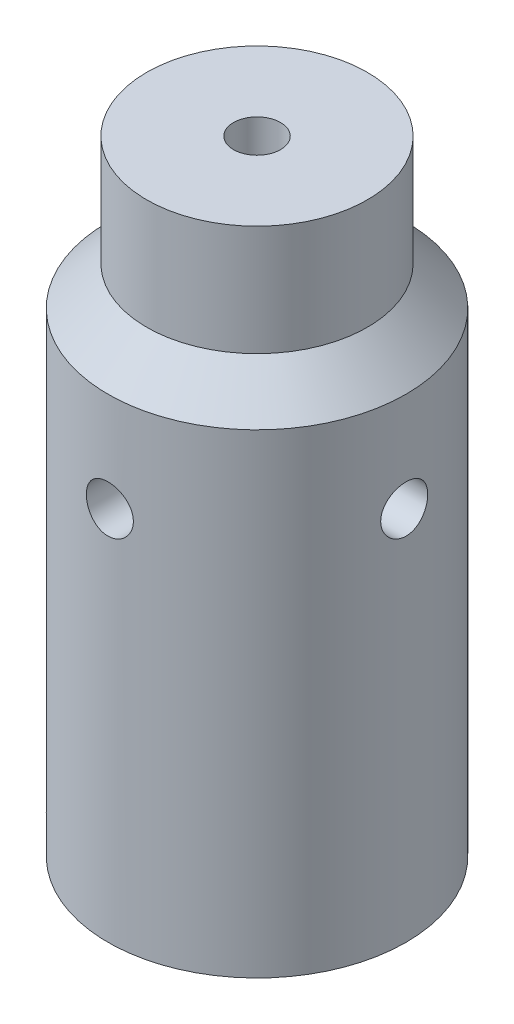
ISO-10303-21;
HEADER;
FILE_DESCRIPTION(('STEP AP214'),'2;1');
FILE_NAME('part.step','',(''),(''),'','','');
FILE_SCHEMA(('AUTOMOTIVE_DESIGN { 1 0 10303 214 1 1 1 1 }'));
ENDSEC;
DATA;
#1=APPLICATION_CONTEXT('core data for automotive mechanical design processes');
#2=APPLICATION_PROTOCOL_DEFINITION('international standard','automotive_design',2000,#1);
#3=PRODUCT_CONTEXT('',#1,'mechanical');
#4=PRODUCT('Part','Part','',(#3));
#5=PRODUCT_RELATED_PRODUCT_CATEGORY('part','',(#4));
#6=PRODUCT_DEFINITION_FORMATION('','',#4);
#7=PRODUCT_DEFINITION_CONTEXT('part definition',#1,'design');
#8=PRODUCT_DEFINITION('design','',#6,#7);
#9=PRODUCT_DEFINITION_SHAPE('','',#8);
#10=(LENGTH_UNIT() NAMED_UNIT(*) SI_UNIT(.MILLI.,.METRE.));
#11=(NAMED_UNIT(*) PLANE_ANGLE_UNIT() SI_UNIT($,.RADIAN.));
#12=(NAMED_UNIT(*) SI_UNIT($,.STERADIAN.) SOLID_ANGLE_UNIT());
#13=UNCERTAINTY_MEASURE_WITH_UNIT(LENGTH_MEASURE(1.E-05),#10,'distance_accuracy_value','');
#14=(GEOMETRIC_REPRESENTATION_CONTEXT(3) GLOBAL_UNCERTAINTY_ASSIGNED_CONTEXT((#13)) GLOBAL_UNIT_ASSIGNED_CONTEXT((#10,
#11,#12)) REPRESENTATION_CONTEXT('',''));
#15=CARTESIAN_POINT('',(0.,0.,0.));
#16=DIRECTION('',(0.,0.,1.));
#17=DIRECTION('',(1.,0.,0.));
#18=AXIS2_PLACEMENT_3D('',#15,#16,#17);
#19=CARTESIAN_POINT('',(0.,0.,0.));
#20=DIRECTION('',(0.,1.,0.));
#21=DIRECTION('',(-1.,0.,0.));
#22=AXIS2_PLACEMENT_3D('',#19,#20,#21);
#23=CYLINDRICAL_SURFACE('',#22,17.145);
#24=CARTESIAN_POINT('',(0.,40.005,0.));
#25=DIRECTION('',(0.,1.,0.));
#26=DIRECTION('',(-1.,0.,0.));
#27=AXIS2_PLACEMENT_3D('',#24,#25,#26);
#28=CIRCLE('',#27,17.145);
#29=CARTESIAN_POINT('',(-17.145,40.005,0.));
#30=VERTEX_POINT('',#29);
#31=EDGE_CURVE('E177',#30,#30,#28,.T.);
#32=ORIENTED_EDGE('',*,*,#31,.F.);
#33=EDGE_LOOP('',(#32));
#34=FACE_BOUND('',#33,.T.);
#35=CARTESIAN_POINT('',(0.,-14.605,0.));
#36=DIRECTION('',(0.,1.,0.));
#37=DIRECTION('',(-1.,0.,0.));
#38=AXIS2_PLACEMENT_3D('',#35,#36,#37);
#39=CIRCLE('',#38,17.145);
#40=CARTESIAN_POINT('',(-17.145,-14.605,0.));
#41=VERTEX_POINT('',#40);
#42=EDGE_CURVE('E174',#41,#41,#39,.T.);
#43=ORIENTED_EDGE('',*,*,#42,.T.);
#44=EDGE_LOOP('',(#43));
#45=FACE_BOUND('',#44,.T.);
#46=CARTESIAN_POINT('',(17.145,31.2801,0.));
#47=CARTESIAN_POINT('',(17.1449974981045,31.2800938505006,0.150941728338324));
#48=CARTESIAN_POINT('',(17.1429858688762,31.2674237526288,0.301968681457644));
#49=CARTESIAN_POINT('',(17.1351547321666,31.21709469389,0.59979461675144));
#50=CARTESIAN_POINT('',(17.1293316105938,31.1794120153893,0.746589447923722));
#51=CARTESIAN_POINT('',(17.114531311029,31.0802173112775,1.03159845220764));
#52=CARTESIAN_POINT('',(17.1055566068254,31.0187239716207,1.16981925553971));
#53=CARTESIAN_POINT('',(17.0854426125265,30.8737006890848,1.4339611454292));
#54=CARTESIAN_POINT('',(17.0743035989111,30.7901735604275,1.55988379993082));
#55=CARTESIAN_POINT('',(17.0509907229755,30.6026882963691,1.79695826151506));
#56=CARTESIAN_POINT('',(17.0388095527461,30.4985777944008,1.90798886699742));
#57=CARTESIAN_POINT('',(17.0148418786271,30.273209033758,2.11108120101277));
#58=CARTESIAN_POINT('',(17.0030553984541,30.1519497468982,2.20314179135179));
#59=CARTESIAN_POINT('',(16.9811407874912,29.8949027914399,2.3661590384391));
#60=CARTESIAN_POINT('',(16.9710221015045,29.7590391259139,2.43699724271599));
#61=CARTESIAN_POINT('',(16.9536892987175,29.4771553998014,2.55480167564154));
#62=CARTESIAN_POINT('',(16.9464750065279,29.3311359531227,2.60176934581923));
#63=CARTESIAN_POINT('',(16.9358400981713,29.0343650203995,2.67012054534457));
#64=CARTESIAN_POINT('',(16.9323886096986,28.8836626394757,2.69171238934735));
#65=CARTESIAN_POINT('',(16.9295765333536,28.5807373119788,2.70934461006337));
#66=CARTESIAN_POINT('',(16.9302156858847,28.4285144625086,2.70538660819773));
#67=CARTESIAN_POINT('',(16.9354844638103,28.1283478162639,2.67220147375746));
#68=CARTESIAN_POINT('',(16.9400773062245,27.9803775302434,2.64320725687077));
#69=CARTESIAN_POINT('',(16.9526784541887,27.691428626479,2.56113775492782));
#70=CARTESIAN_POINT('',(16.9606868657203,27.5504502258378,2.50806172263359));
#71=CARTESIAN_POINT('',(16.979257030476,27.2787834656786,2.37909575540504));
#72=CARTESIAN_POINT('',(16.9898296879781,27.1481422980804,2.30310804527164));
#73=CARTESIAN_POINT('',(17.012329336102,26.901376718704,2.13054526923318));
#74=CARTESIAN_POINT('',(17.0242564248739,26.7852533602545,2.03396871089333));
#75=CARTESIAN_POINT('',(17.0482831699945,26.5694705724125,1.82169547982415));
#76=CARTESIAN_POINT('',(17.0603832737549,26.4700079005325,1.70579874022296));
#77=CARTESIAN_POINT('',(17.0832701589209,26.2919135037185,1.45885452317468));
#78=CARTESIAN_POINT('',(17.0940569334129,26.2132818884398,1.32780696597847));
#79=CARTESIAN_POINT('',(17.1131148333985,26.0790680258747,1.05410396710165));
#80=CARTESIAN_POINT('',(17.1213841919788,26.0235019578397,0.911440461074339));
#81=CARTESIAN_POINT('',(17.1344610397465,25.9371727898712,0.618646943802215));
#82=CARTESIAN_POINT('',(17.1392687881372,25.9064078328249,0.46851749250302));
#83=CARTESIAN_POINT('',(17.1448461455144,25.870818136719,0.16675082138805));
#84=CARTESIAN_POINT('',(17.1456578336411,25.8657230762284,0.0151462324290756));
#85=CARTESIAN_POINT('',(17.143266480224,25.8808988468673,-0.28675145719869));
#86=CARTESIAN_POINT('',(17.1400635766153,25.9011688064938,-0.437044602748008));
#87=CARTESIAN_POINT('',(17.1300289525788,25.9662744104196,-0.731226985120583));
#88=CARTESIAN_POINT('',(17.1232168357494,26.0109773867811,-0.875146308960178));
#89=CARTESIAN_POINT('',(17.106724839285,26.12353947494,-1.15344752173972));
#90=CARTESIAN_POINT('',(17.0970448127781,26.1913997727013,-1.28782892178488));
#91=CARTESIAN_POINT('',(17.0757873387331,26.3489775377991,-1.54442179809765));
#92=CARTESIAN_POINT('',(17.0641953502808,26.4388652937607,-1.66652747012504));
#93=CARTESIAN_POINT('',(17.0404468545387,26.637710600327,-1.89401744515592));
#94=CARTESIAN_POINT('',(17.028290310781,26.7466693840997,-1.99940066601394));
#95=CARTESIAN_POINT('',(17.0046481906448,26.9817713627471,-2.19144629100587));
#96=CARTESIAN_POINT('',(16.993169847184,27.1080639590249,-2.27792682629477));
#97=CARTESIAN_POINT('',(16.9723150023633,27.3735423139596,-2.42844533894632));
#98=CARTESIAN_POINT('',(16.9629384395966,27.5127276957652,-2.49248397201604));
#99=CARTESIAN_POINT('',(16.9474020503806,27.799513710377,-2.59602344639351));
#100=CARTESIAN_POINT('',(16.9412300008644,27.9470799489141,-2.63561763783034));
#101=CARTESIAN_POINT('',(16.9327697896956,28.246873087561,-2.68943994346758));
#102=CARTESIAN_POINT('',(16.9304813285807,28.3990996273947,-2.70367001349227));
#103=CARTESIAN_POINT('',(16.9300593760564,28.7020780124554,-2.70630995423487));
#104=CARTESIAN_POINT('',(16.9318798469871,28.8528273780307,-2.69500591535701));
#105=CARTESIAN_POINT('',(16.9393702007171,29.1502516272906,-2.64751411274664));
#106=CARTESIAN_POINT('',(16.9450400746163,29.2969265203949,-2.61132640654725));
#107=CARTESIAN_POINT('',(16.9595736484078,29.5819447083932,-2.51519954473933));
#108=CARTESIAN_POINT('',(16.968434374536,29.7202956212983,-2.45528249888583));
#109=CARTESIAN_POINT('',(16.9883545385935,29.9850277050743,-2.31342662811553));
#110=CARTESIAN_POINT('',(16.9994140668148,30.1114083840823,-2.23148689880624));
#111=CARTESIAN_POINT('',(17.0226327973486,30.3500624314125,-2.04688050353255));
#112=CARTESIAN_POINT('',(17.0348024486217,30.4621713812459,-1.9440025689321));
#113=CARTESIAN_POINT('',(17.0587847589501,30.6676342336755,-1.72088642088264));
#114=CARTESIAN_POINT('',(17.0705973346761,30.7609837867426,-1.60064419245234));
#115=CARTESIAN_POINT('',(17.0926178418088,30.9267949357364,-1.34534108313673));
#116=CARTESIAN_POINT('',(17.1028154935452,30.9991249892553,-1.21019388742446));
#117=CARTESIAN_POINT('',(17.120356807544,31.1199479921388,-0.929567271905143));
#118=CARTESIAN_POINT('',(17.1277033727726,31.1684652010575,-0.784098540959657));
#119=CARTESIAN_POINT('',(17.1370711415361,31.2294937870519,-0.531679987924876));
#120=CARTESIAN_POINT('',(17.1400289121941,31.2484414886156,-0.426274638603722));
#121=CARTESIAN_POINT('',(17.1439942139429,31.2737466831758,-0.213927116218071));
#122=CARTESIAN_POINT('',(17.1450017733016,31.2801043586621,-0.106984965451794));
#123=CARTESIAN_POINT('',(17.145,31.2801,0.));
#124=B_SPLINE_CURVE_WITH_KNOTS('',3,(#46,#47,#48,#49,#50,#51,#52,#53,#54,#55,#56,#57,#58,#59,
#60,#61,#62,#63,#64,#65,#66,#67,#68,#69,#70,#71,#72,#73,#74,#75,#76,#77,#78,#79,#80,#81,#82,#83,
#84,#85,#86,#87,#88,#89,#90,#91,#92,#93,#94,#95,#96,#97,#98,#99,#100,#101,#102,#103,#104,#105,
#106,#107,#108,#109,#110,#111,#112,#113,#114,#115,#116,#117,#118,#119,#120,#121,#122,#123),
.UNSPECIFIED.,.T.,.F.,(4,2,2,2,2,2,2,2,2,2,2,2,2,2,2,2,2,2,2,2,2,2,2,2,2,2,2,2,2,2,2,2,2,2,2,2,
2,2,4),(0.,0.452434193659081,0.905298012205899,1.3578071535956,1.81025852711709,
2.26619377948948,2.72215637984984,3.18061844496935,3.63905282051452,4.09369694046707,
4.54831220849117,4.99874313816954,5.44918804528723,5.90158309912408,6.35401095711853,
6.8114536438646,7.26889873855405,7.72666416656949,8.18439531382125,8.63729601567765,
9.09018115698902,9.54063127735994,9.99110447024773,10.4451765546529,10.8992780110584,
11.3575729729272,11.8158545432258,12.2723749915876,12.7288602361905,13.1802563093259,
13.6316513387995,14.0826267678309,14.5336207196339,14.9894134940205,15.4453118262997,
15.9040046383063,16.3622291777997,16.6829115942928,17.0035893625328),.UNSPECIFIED.);
#125=CARTESIAN_POINT('',(17.145,31.2801,0.));
#126=VERTEX_POINT('',#125);
#127=EDGE_CURVE('E48',#126,#126,#124,.T.);
#128=ORIENTED_EDGE('',*,*,#127,.F.);
#129=EDGE_LOOP('',(#128));
#130=FACE_BOUND('',#129,.T.);
#131=CARTESIAN_POINT('',(0.,31.2801,17.1450000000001));
#132=CARTESIAN_POINT('',(-0.150941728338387,31.2800938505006,17.1449974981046));
#133=CARTESIAN_POINT('',(-0.301968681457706,31.2674237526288,17.1429858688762));
#134=CARTESIAN_POINT('',(-0.5997946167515,31.21709469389,17.1351547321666));
#135=CARTESIAN_POINT('',(-0.746589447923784,31.1794120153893,17.1293316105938));
#136=CARTESIAN_POINT('',(-1.0315984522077,31.0802173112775,17.114531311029));
#137=CARTESIAN_POINT('',(-1.16981925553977,31.0187239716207,17.1055566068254));
#138=CARTESIAN_POINT('',(-1.43396114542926,30.8737006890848,17.0854426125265));
#139=CARTESIAN_POINT('',(-1.55988379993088,30.7901735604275,17.0743035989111));
#140=CARTESIAN_POINT('',(-1.79695826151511,30.6026882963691,17.0509907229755));
#141=CARTESIAN_POINT('',(-1.90798886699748,30.4985777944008,17.0388095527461));
#142=CARTESIAN_POINT('',(-2.11108120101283,30.273209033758,17.0148418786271));
#143=CARTESIAN_POINT('',(-2.20314179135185,30.1519497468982,17.0030553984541));
#144=CARTESIAN_POINT('',(-2.36615903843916,29.8949027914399,16.9811407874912));
#145=CARTESIAN_POINT('',(-2.43699724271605,29.7590391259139,16.9710221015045));
#146=CARTESIAN_POINT('',(-2.5548016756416,29.4771553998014,16.9536892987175));
#147=CARTESIAN_POINT('',(-2.6017693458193,29.3311359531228,16.9464750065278));
#148=CARTESIAN_POINT('',(-2.67012054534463,29.0343650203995,16.9358400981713));
#149=CARTESIAN_POINT('',(-2.69171238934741,28.8836626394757,16.9323886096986));
#150=CARTESIAN_POINT('',(-2.70934461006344,28.5807373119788,16.9295765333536));
#151=CARTESIAN_POINT('',(-2.70538660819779,28.4285144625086,16.9302156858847));
#152=CARTESIAN_POINT('',(-2.67220147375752,28.1283478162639,16.9354844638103));
#153=CARTESIAN_POINT('',(-2.64320725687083,27.9803775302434,16.9400773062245));
#154=CARTESIAN_POINT('',(-2.56113775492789,27.691428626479,16.9526784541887));
#155=CARTESIAN_POINT('',(-2.50806172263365,27.5504502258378,16.9606868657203));
#156=CARTESIAN_POINT('',(-2.3790957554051,27.2787834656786,16.979257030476));
#157=CARTESIAN_POINT('',(-2.30310804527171,27.1481422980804,16.9898296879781));
#158=CARTESIAN_POINT('',(-2.13054526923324,26.901376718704,17.012329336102));
#159=CARTESIAN_POINT('',(-2.0339687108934,26.7852533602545,17.0242564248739));
#160=CARTESIAN_POINT('',(-1.82169547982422,26.5694705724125,17.0482831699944));
#161=CARTESIAN_POINT('',(-1.70579874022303,26.4700079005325,17.0603832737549));
#162=CARTESIAN_POINT('',(-1.45885452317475,26.2919135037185,17.0832701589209));
#163=CARTESIAN_POINT('',(-1.32780696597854,26.2132818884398,17.0940569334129));
#164=CARTESIAN_POINT('',(-1.05410396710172,26.0790680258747,17.1131148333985));
#165=CARTESIAN_POINT('',(-0.911440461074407,26.0235019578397,17.1213841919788));
#166=CARTESIAN_POINT('',(-0.618646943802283,25.9371727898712,17.1344610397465));
#167=CARTESIAN_POINT('',(-0.468517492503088,25.9064078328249,17.1392687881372));
#168=CARTESIAN_POINT('',(-0.166750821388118,25.870818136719,17.1448461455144));
#169=CARTESIAN_POINT('',(-0.015146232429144,25.8657230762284,17.1456578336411));
#170=CARTESIAN_POINT('',(0.286751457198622,25.8808988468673,17.143266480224));
#171=CARTESIAN_POINT('',(0.437044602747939,25.9011688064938,17.1400635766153));
#172=CARTESIAN_POINT('',(0.731226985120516,25.9662744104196,17.1300289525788));
#173=CARTESIAN_POINT('',(0.875146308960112,26.0109773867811,17.1232168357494));
#174=CARTESIAN_POINT('',(1.15344752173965,26.12353947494,17.106724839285));
#175=CARTESIAN_POINT('',(1.28782892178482,26.1913997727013,17.0970448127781));
#176=CARTESIAN_POINT('',(1.54442179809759,26.3489775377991,17.0757873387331));
#177=CARTESIAN_POINT('',(1.66652747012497,26.4388652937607,17.0641953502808));
#178=CARTESIAN_POINT('',(1.89401744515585,26.637710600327,17.0404468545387));
#179=CARTESIAN_POINT('',(1.99940066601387,26.7466693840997,17.028290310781));
#180=CARTESIAN_POINT('',(2.19144629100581,26.9817713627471,17.0046481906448));
#181=CARTESIAN_POINT('',(2.2779268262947,27.1080639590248,16.993169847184));
#182=CARTESIAN_POINT('',(2.42844533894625,27.3735423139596,16.9723150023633));
#183=CARTESIAN_POINT('',(2.49248397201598,27.5127276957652,16.9629384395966));
#184=CARTESIAN_POINT('',(2.59602344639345,27.799513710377,16.9474020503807));
#185=CARTESIAN_POINT('',(2.63561763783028,27.9470799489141,16.9412300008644));
#186=CARTESIAN_POINT('',(2.68943994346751,28.246873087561,16.9327697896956));
#187=CARTESIAN_POINT('',(2.70367001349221,28.3990996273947,16.9304813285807));
#188=CARTESIAN_POINT('',(2.70630995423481,28.7020780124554,16.9300593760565));
#189=CARTESIAN_POINT('',(2.69500591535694,28.8528273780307,16.9318798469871));
#190=CARTESIAN_POINT('',(2.64751411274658,29.1502516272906,16.9393702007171));
#191=CARTESIAN_POINT('',(2.61132640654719,29.2969265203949,16.9450400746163));
#192=CARTESIAN_POINT('',(2.51519954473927,29.5819447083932,16.9595736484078));
#193=CARTESIAN_POINT('',(2.45528249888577,29.7202956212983,16.968434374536));
#194=CARTESIAN_POINT('',(2.31342662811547,29.9850277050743,16.9883545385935));
#195=CARTESIAN_POINT('',(2.23148689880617,30.1114083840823,16.9994140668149));
#196=CARTESIAN_POINT('',(2.04688050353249,30.3500624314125,17.0226327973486));
#197=CARTESIAN_POINT('',(1.94400256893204,30.4621713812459,17.0348024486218));
#198=CARTESIAN_POINT('',(1.72088642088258,30.6676342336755,17.0587847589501));
#199=CARTESIAN_POINT('',(1.60064419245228,30.7609837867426,17.0705973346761));
#200=CARTESIAN_POINT('',(1.34534108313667,30.9267949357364,17.0926178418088));
#201=CARTESIAN_POINT('',(1.2101938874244,30.9991249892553,17.1028154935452));
#202=CARTESIAN_POINT('',(0.929567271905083,31.1199479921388,17.120356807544));
#203=CARTESIAN_POINT('',(0.784098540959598,31.1684652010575,17.1277033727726));
#204=CARTESIAN_POINT('',(0.531679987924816,31.2294937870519,17.1370711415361));
#205=CARTESIAN_POINT('',(0.426274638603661,31.2484414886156,17.1400289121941));
#206=CARTESIAN_POINT('',(0.213927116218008,31.2737466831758,17.1439942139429));
#207=CARTESIAN_POINT('',(0.106984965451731,31.2801043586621,17.1450017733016));
#208=CARTESIAN_POINT('',(0.,31.2801,17.1450000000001));
#209=B_SPLINE_CURVE_WITH_KNOTS('',3,(#131,#132,#133,#134,#135,#136,#137,#138,#139,#140,#141,
#142,#143,#144,#145,#146,#147,#148,#149,#150,#151,#152,#153,#154,#155,#156,#157,#158,#159,#160,
#161,#162,#163,#164,#165,#166,#167,#168,#169,#170,#171,#172,#173,#174,#175,#176,#177,#178,#179,
#180,#181,#182,#183,#184,#185,#186,#187,#188,#189,#190,#191,#192,#193,#194,#195,#196,#197,#198,
#199,#200,#201,#202,#203,#204,#205,#206,#207,#208),.UNSPECIFIED.,.T.,.F.,(4,2,2,2,2,2,2,2,2,2,2,
2,2,2,2,2,2,2,2,2,2,2,2,2,2,2,2,2,2,2,2,2,2,2,2,2,2,2,4),(0.,0.452434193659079,
0.905298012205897,1.3578071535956,1.81025852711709,2.26619377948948,2.72215637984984,
3.18061844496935,3.63905282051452,4.09369694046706,4.54831220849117,4.99874313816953,
5.44918804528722,5.90158309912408,6.35401095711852,6.81145364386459,7.26889873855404,
7.72666416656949,8.18439531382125,8.63729601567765,9.09018115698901,9.54063127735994,
9.99110447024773,10.4451765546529,10.8992780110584,11.3575729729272,11.8158545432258,
12.2723749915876,12.7288602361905,13.1802563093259,13.6316513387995,14.0826267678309,
14.5336207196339,14.9894134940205,15.4453118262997,15.9040046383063,16.3622291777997,
16.6829115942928,17.0035893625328),.UNSPECIFIED.);
#210=CARTESIAN_POINT('',(0.,31.2801,17.1450000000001));
#211=VERTEX_POINT('',#210);
#212=EDGE_CURVE('E11',#211,#211,#209,.T.);
#213=ORIENTED_EDGE('',*,*,#212,.F.);
#214=EDGE_LOOP('',(#213));
#215=FACE_BOUND('',#214,.T.);
#216=CARTESIAN_POINT('',(-15.8623,-10.795,6.50680134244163));
#217=CARTESIAN_POINT('',(-15.8622968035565,-10.7490137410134,6.50680975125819));
#218=CARTESIAN_POINT('',(-15.8606124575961,-10.7029725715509,6.5109198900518));
#219=CARTESIAN_POINT('',(-15.8540801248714,-10.6124433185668,6.52680899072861));
#220=CARTESIAN_POINT('',(-15.8492248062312,-10.5679590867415,6.53860572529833));
#221=CARTESIAN_POINT('',(-15.8351512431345,-10.4697435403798,6.57262730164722));
#222=CARTESIAN_POINT('',(-15.825100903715,-10.4168286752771,6.59682651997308));
#223=CARTESIAN_POINT('',(-15.8017746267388,-10.3157854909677,6.65250720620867));
#224=CARTESIAN_POINT('',(-15.7884913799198,-10.2676683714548,6.68400516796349));
#225=CARTESIAN_POINT('',(-15.7612248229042,-10.1812523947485,6.748028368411));
#226=CARTESIAN_POINT('',(-15.747500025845,-10.1424615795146,6.78001376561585));
#227=CARTESIAN_POINT('',(-15.7185672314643,-10.067980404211,6.84682414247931));
#228=CARTESIAN_POINT('',(-15.7033580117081,-10.0322926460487,6.88165145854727));
#229=CARTESIAN_POINT('',(-15.6558719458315,-9.92918415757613,6.98933639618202));
#230=CARTESIAN_POINT('',(-15.6217805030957,-9.86584819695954,7.06529324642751));
#231=CARTESIAN_POINT('',(-15.5468766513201,-9.74242354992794,7.2287256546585));
#232=CARTESIAN_POINT('',(-15.5057363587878,-9.68312023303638,7.31662544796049));
#233=CARTESIAN_POINT('',(-15.4199425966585,-9.57246260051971,7.4957504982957));
#234=CARTESIAN_POINT('',(-15.3752854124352,-9.52111686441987,7.58697921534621));
#235=CARTESIAN_POINT('',(-15.2827916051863,-9.42512939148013,7.77161491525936));
#236=CARTESIAN_POINT('',(-15.2349479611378,-9.38050321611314,7.86502639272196));
#237=CARTESIAN_POINT('',(-15.1363963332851,-9.29736569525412,8.05306224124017));
#238=CARTESIAN_POINT('',(-15.0856876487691,-9.25885585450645,8.14768690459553));
#239=CARTESIAN_POINT('',(-14.9533565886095,-9.16823166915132,8.38904009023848));
#240=CARTESIAN_POINT('',(-14.8698650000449,-9.12004434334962,8.53623336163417));
#241=CARTESIAN_POINT('',(-14.6968103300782,-9.03677242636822,8.83085649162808));
#242=CARTESIAN_POINT('',(-14.6072434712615,-9.00169607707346,8.97828644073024));
#243=CARTESIAN_POINT('',(-14.4226183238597,-8.94518833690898,9.27195258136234));
#244=CARTESIAN_POINT('',(-14.3275710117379,-8.92373063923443,9.41819053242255));
#245=CARTESIAN_POINT('',(-14.1324350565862,-8.89550919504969,9.70854872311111));
#246=CARTESIAN_POINT('',(-14.0323501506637,-8.88873471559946,9.8526704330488));
#247=CARTESIAN_POINT('',(-13.8067580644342,-8.89195473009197,10.1670545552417));
#248=CARTESIAN_POINT('',(-13.680245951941,-8.90567226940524,10.3366179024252));
#249=CARTESIAN_POINT('',(-13.4877452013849,-8.94761394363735,10.5850266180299));
#250=CARTESIAN_POINT('',(-13.4231426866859,-8.96514691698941,10.6668164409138));
#251=CARTESIAN_POINT('',(-13.2935105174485,-9.00808332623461,10.827939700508));
#252=CARTESIAN_POINT('',(-13.2284810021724,-9.0334843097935,10.9072738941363));
#253=CARTESIAN_POINT('',(-13.0700011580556,-9.106115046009,11.0971778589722));
#254=CARTESIAN_POINT('',(-12.9766537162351,-9.15803148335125,11.2061076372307));
#255=CARTESIAN_POINT('',(-12.7935319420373,-9.28274842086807,11.4147153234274));
#256=CARTESIAN_POINT('',(-12.7037524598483,-9.35551747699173,11.5144068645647));
#257=CARTESIAN_POINT('',(-12.556837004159,-9.50071522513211,11.6741234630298));
#258=CARTESIAN_POINT('',(-12.4976379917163,-9.56744666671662,11.7374040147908));
#259=CARTESIAN_POINT('',(-12.3862765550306,-9.71364758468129,11.8548594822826));
#260=CARTESIAN_POINT('',(-12.3341044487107,-9.79309919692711,11.9090469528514));
#261=CARTESIAN_POINT('',(-12.249337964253,-9.94761561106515,11.9961537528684));
#262=CARTESIAN_POINT('',(-12.2149105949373,-10.020488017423,12.031159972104));
#263=CARTESIAN_POINT('',(-12.1547119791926,-10.1733618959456,12.091974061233));
#264=CARTESIAN_POINT('',(-12.1289364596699,-10.253359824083,12.1177864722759));
#265=CARTESIAN_POINT('',(-12.0877543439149,-10.4192701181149,12.1588687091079));
#266=CARTESIAN_POINT('',(-12.0724220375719,-10.5052201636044,12.1740630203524));
#267=CARTESIAN_POINT('',(-12.0537765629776,-10.6796689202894,12.1925256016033));
#268=CARTESIAN_POINT('',(-12.0504563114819,-10.7681660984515,12.1958008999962));
#269=CARTESIAN_POINT('',(-12.0557821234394,-10.9340140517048,12.1905348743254));
#270=CARTESIAN_POINT('',(-12.0630741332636,-11.0114579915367,12.1833307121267));
#271=CARTESIAN_POINT('',(-12.0867021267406,-11.1635225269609,12.1598902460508));
#272=CARTESIAN_POINT('',(-12.103038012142,-11.238143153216,12.1436540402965));
#273=CARTESIAN_POINT('',(-12.1438554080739,-11.3833746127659,12.1028355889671));
#274=CARTESIAN_POINT('',(-12.1684014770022,-11.4539483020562,12.0781871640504));
#275=CARTESIAN_POINT('',(-12.2242294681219,-11.589266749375,12.0216812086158));
#276=CARTESIAN_POINT('',(-12.2555144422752,-11.6540088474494,11.989820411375));
#277=CARTESIAN_POINT('',(-12.3387273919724,-11.8047653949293,11.9042755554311));
#278=CARTESIAN_POINT('',(-12.3936100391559,-11.8872447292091,11.8472223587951));
#279=CARTESIAN_POINT('',(-12.5108591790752,-12.0383949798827,11.7233421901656));
#280=CARTESIAN_POINT('',(-12.5732419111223,-12.107035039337,11.6564939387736));
#281=CARTESIAN_POINT('',(-12.7298789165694,-12.257441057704,11.4856265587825));
#282=CARTESIAN_POINT('',(-12.8264545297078,-12.3324813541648,11.37784361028));
#283=CARTESIAN_POINT('',(-13.0230107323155,-12.459286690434,11.1523416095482));
#284=CARTESIAN_POINT('',(-13.1229961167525,-12.511017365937,11.0346081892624));
#285=CARTESIAN_POINT('',(-13.2989848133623,-12.584531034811,10.8213841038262));
#286=CARTESIAN_POINT('',(-13.3750086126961,-12.6105166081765,10.7273024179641));
#287=CARTESIAN_POINT('',(-13.5261305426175,-12.652220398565,10.5361124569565));
#288=CARTESIAN_POINT('',(-13.6012281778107,-12.6679333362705,10.4390026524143));
#289=CARTESIAN_POINT('',(-13.7499722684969,-12.6901803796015,10.2422916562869));
#290=CARTESIAN_POINT('',(-13.8236145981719,-12.6966912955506,10.1426848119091));
#291=CARTESIAN_POINT('',(-13.9688162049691,-12.7013494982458,9.94175916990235));
#292=CARTESIAN_POINT('',(-14.0403749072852,-12.6994944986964,9.84043991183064));
#293=CARTESIAN_POINT('',(-14.209415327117,-12.6858395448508,9.59550423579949));
#294=CARTESIAN_POINT('',(-14.3057330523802,-12.6703359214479,9.45128382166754));
#295=CARTESIAN_POINT('',(-14.4930589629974,-12.6256463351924,9.16144511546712));
#296=CARTESIAN_POINT('',(-14.5840638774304,-12.5964520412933,9.01582602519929));
#297=CARTESIAN_POINT('',(-14.7600618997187,-12.5251985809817,8.72470335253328));
#298=CARTESIAN_POINT('',(-14.8450713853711,-12.4831762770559,8.57920062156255));
#299=CARTESIAN_POINT('',(-15.0089565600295,-12.3862625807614,8.28914593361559));
#300=CARTESIAN_POINT('',(-15.0878370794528,-12.3313814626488,8.14459331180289));
#301=CARTESIAN_POINT('',(-15.2166982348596,-12.2259662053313,7.90039057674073));
#302=CARTESIAN_POINT('',(-15.2683320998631,-12.1789378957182,7.80009144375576));
#303=CARTESIAN_POINT('',(-15.3681776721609,-12.077015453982,7.60147889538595));
#304=CARTESIAN_POINT('',(-15.416383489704,-12.0221082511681,7.50316909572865));
#305=CARTESIAN_POINT('',(-15.4887168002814,-11.9288428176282,7.35216675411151));
#306=CARTESIAN_POINT('',(-15.5142196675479,-11.8936352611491,7.29818185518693));
#307=CARTESIAN_POINT('',(-15.5637702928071,-11.8198204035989,7.19190579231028));
#308=CARTESIAN_POINT('',(-15.5878185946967,-11.7812143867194,7.13961399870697));
#309=CARTESIAN_POINT('',(-15.6341691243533,-11.7001572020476,7.03753602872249));
#310=CARTESIAN_POINT('',(-15.6564762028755,-11.6577174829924,6.98774304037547));
#311=CARTESIAN_POINT('',(-15.6990316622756,-11.5682082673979,6.89160228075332));
#312=CARTESIAN_POINT('',(-15.7192826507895,-11.5211447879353,6.8452501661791));
#313=CARTESIAN_POINT('',(-15.7538834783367,-11.4300281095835,6.76518625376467));
#314=CARTESIAN_POINT('',(-15.7686493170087,-11.3868481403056,6.73067126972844));
#315=CARTESIAN_POINT('',(-15.7958100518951,-11.2961416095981,6.66667939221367));
#316=CARTESIAN_POINT('',(-15.8082061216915,-11.2486172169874,6.63720000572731));
#317=CARTESIAN_POINT('',(-15.828087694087,-11.1569569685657,6.58962999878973));
#318=CARTESIAN_POINT('',(-15.8360407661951,-11.1134859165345,6.57047347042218));
#319=CARTESIAN_POINT('',(-15.8490547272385,-11.023746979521,6.53902017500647));
#320=CARTESIAN_POINT('',(-15.8541241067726,-10.9774877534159,6.52670327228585));
#321=CARTESIAN_POINT('',(-15.859071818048,-10.9081071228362,6.51466666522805));
#322=CARTESIAN_POINT('',(-15.8602780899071,-10.8856095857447,6.51172856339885));
#323=CARTESIAN_POINT('',(-15.861893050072,-10.8404125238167,6.50779363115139));
#324=CARTESIAN_POINT('',(-15.8623015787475,-10.8177129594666,6.50679718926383));
#325=CARTESIAN_POINT('',(-15.8623,-10.795,6.50680134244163));
#326=B_SPLINE_CURVE_WITH_KNOTS('',3,(#216,#217,#218,#219,#220,#221,#222,#223,#224,#225,#226,
#227,#228,#229,#230,#231,#232,#233,#234,#235,#236,#237,#238,#239,#240,#241,#242,#243,#244,#245,
#246,#247,#248,#249,#250,#251,#252,#253,#254,#255,#256,#257,#258,#259,#260,#261,#262,#263,#264,
#265,#266,#267,#268,#269,#270,#271,#272,#273,#274,#275,#276,#277,#278,#279,#280,#281,#282,#283,
#284,#285,#286,#287,#288,#289,#290,#291,#292,#293,#294,#295,#296,#297,#298,#299,#300,#301,#302,
#303,#304,#305,#306,#307,#308,#309,#310,#311,#312,#313,#314,#315,#316,#317,#318,#319,#320,#321,
#322,#323,#324,#325),.UNSPECIFIED.,.T.,.F.,(4,2,2,2,2,2,2,2,2,2,2,2,2,2,2,2,2,2,2,2,2,2,2,2,2,2,
2,2,2,2,2,2,2,2,2,2,2,2,2,2,2,2,2,2,2,2,2,2,2,2,2,2,2,2,4),(0.,0.137856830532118,
0.276033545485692,0.452165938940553,0.628700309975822,0.784823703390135,0.941076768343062,
1.25409373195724,1.59485429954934,1.93597974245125,2.27788341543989,2.61987107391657,
3.14706835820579,3.67459649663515,4.20110249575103,4.7272235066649,5.36121839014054,
5.67802539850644,5.99473376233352,6.45099506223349,6.90657194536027,7.23360512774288,
7.56018299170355,7.82275162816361,8.0851903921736,8.34947709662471,8.613607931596,
8.84684854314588,9.08008662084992,9.31520358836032,9.55042726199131,9.89148504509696,
10.2332950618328,10.719661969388,11.2067435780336,11.5774134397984,11.9482736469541,
12.3200667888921,12.6919615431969,13.2136031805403,13.7355626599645,14.2560361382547,
14.7760951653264,15.1425113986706,15.5095426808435,15.7173906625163,15.9251604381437,
16.1323290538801,16.3392315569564,16.5105676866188,16.681818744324,16.825809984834,
16.9693750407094,17.0374499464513,17.1055384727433),.UNSPECIFIED.);
#327=CARTESIAN_POINT('',(-15.8623,-10.795,6.50680134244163));
#328=VERTEX_POINT('',#327);
#329=EDGE_CURVE('E67',#328,#328,#326,.T.);
#330=ORIENTED_EDGE('',*,*,#329,.T.);
#331=EDGE_LOOP('',(#330));
#332=FACE_BOUND('',#331,.T.);
#333=ADVANCED_FACE('F36',(#34,#45,#130,#215,#332),#23,.T.);
#334=CARTESIAN_POINT('',(0.,-10.795,0.));
#335=DIRECTION('',(0.,1.,0.));
#336=DIRECTION('',(-1.,0.,0.));
#337=AXIS2_PLACEMENT_3D('',#334,#335,#336);
#338=TOROIDAL_SURFACE('',#337,13.9573,1.905);
#339=CARTESIAN_POINT('',(0.,-12.7,0.));
#340=DIRECTION('',(0.,1.,0.));
#341=DIRECTION('',(-1.,0.,0.));
#342=AXIS2_PLACEMENT_3D('',#339,#340,#341);
#343=CIRCLE('',#342,13.9573);
#344=CARTESIAN_POINT('',(-13.9573,-12.7,0.));
#345=VERTEX_POINT('',#344);
#346=EDGE_CURVE('E66',#345,#345,#343,.T.);
#347=ORIENTED_EDGE('',*,*,#346,.F.);
#348=CARTESIAN_POINT('',(-13.9573,-8.89,0.));
#349=CARTESIAN_POINT('',(-13.9573000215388,-8.89000024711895,0.0556924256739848));
#350=CARTESIAN_POINT('',(-13.9571333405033,-8.89000010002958,0.111384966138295));
#351=CARTESIAN_POINT('',(-13.9559760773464,-8.8899999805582,0.304730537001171));
#352=CARTESIAN_POINT('',(-13.9541339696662,-8.89000058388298,0.442379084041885));
#353=CARTESIAN_POINT('',(-13.9475760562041,-8.89002109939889,0.757996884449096));
#354=CARTESIAN_POINT('',(-13.9421759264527,-8.89004662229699,0.935952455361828));
#355=CARTESIAN_POINT('',(-13.9317316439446,-8.89016874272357,1.19770402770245));
#356=CARTESIAN_POINT('',(-13.9280078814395,-8.89022064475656,1.2815546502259));
#357=CARTESIAN_POINT('',(-13.9198063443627,-8.89036474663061,1.44923144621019));
#358=CARTESIAN_POINT('',(-13.9153284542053,-8.89045695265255,1.53305761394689));
#359=CARTESIAN_POINT('',(-13.8910350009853,-8.89105066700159,1.95246904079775));
#360=CARTESIAN_POINT('',(-13.865560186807,-8.89194956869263,2.28774694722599));
#361=CARTESIAN_POINT('',(-13.8026999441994,-8.89602246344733,2.95686130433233));
#362=CARTESIAN_POINT('',(-13.7653252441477,-8.89919441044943,3.2906987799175));
#363=CARTESIAN_POINT('',(-13.6893226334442,-8.90865539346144,3.87617005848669));
#364=CARTESIAN_POINT('',(-13.6531873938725,-8.91400419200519,4.12814390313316));
#365=CARTESIAN_POINT('',(-13.5743028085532,-8.92846593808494,4.63094170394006));
#366=CARTESIAN_POINT('',(-13.5315537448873,-8.93757872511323,4.88176570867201));
#367=CARTESIAN_POINT('',(-13.4392943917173,-8.96115691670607,5.38360450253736));
#368=CARTESIAN_POINT('',(-13.3897422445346,-8.9756564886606,5.63461007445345));
#369=CARTESIAN_POINT('',(-13.2843351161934,-9.01195491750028,6.13461985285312));
#370=CARTESIAN_POINT('',(-13.2284838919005,-9.03374943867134,6.38362515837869));
#371=CARTESIAN_POINT('',(-13.1098846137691,-9.08759145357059,6.88285510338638));
#372=CARTESIAN_POINT('',(-13.0470471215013,-9.11978518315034,7.13304371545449));
#373=CARTESIAN_POINT('',(-12.948463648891,-9.17860676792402,7.5058675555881));
#374=CARTESIAN_POINT('',(-12.9148345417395,-9.20000397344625,7.62989262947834));
#375=CARTESIAN_POINT('',(-12.8462618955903,-9.24698434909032,7.87677568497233));
#376=CARTESIAN_POINT('',(-12.8113185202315,-9.27256699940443,7.99963380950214));
#377=CARTESIAN_POINT('',(-12.7405993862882,-9.32848109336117,8.24269679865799));
#378=CARTESIAN_POINT('',(-12.704834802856,-9.35876471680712,8.36291580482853));
#379=CARTESIAN_POINT('',(-12.6323708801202,-9.42532392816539,8.60139159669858));
#380=CARTESIAN_POINT('',(-12.5956717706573,-9.46159805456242,8.71964885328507));
#381=CARTESIAN_POINT('',(-12.5218196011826,-9.5414571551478,8.95294785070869));
#382=CARTESIAN_POINT('',(-12.4846690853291,-9.58501088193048,9.06800098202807));
#383=CARTESIAN_POINT('',(-12.4103380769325,-9.6815952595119,9.2939952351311));
#384=CARTESIAN_POINT('',(-12.3731577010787,-9.73461242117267,9.40494194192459));
#385=CARTESIAN_POINT('',(-12.3203677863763,-9.82011254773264,9.55985738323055));
#386=CARTESIAN_POINT('',(-12.3043441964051,-9.84745715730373,9.60652419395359));
#387=CARTESIAN_POINT('',(-12.2726384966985,-9.90504162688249,9.69821637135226));
#388=CARTESIAN_POINT('',(-12.2569565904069,-9.93528315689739,9.74324077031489));
#389=CARTESIAN_POINT('',(-12.2262355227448,-9.99895721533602,9.8308623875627));
#390=CARTESIAN_POINT('',(-12.2111935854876,-10.0323733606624,9.87347043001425));
#391=CARTESIAN_POINT('',(-12.1819998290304,-10.1030491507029,9.95566533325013));
#392=CARTESIAN_POINT('',(-12.1678470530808,-10.1403045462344,9.99525545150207));
#393=CARTESIAN_POINT('',(-12.1423823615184,-10.2149346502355,10.0661071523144));
#394=CARTESIAN_POINT('',(-12.1309293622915,-10.2518406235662,10.0978055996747));
#395=CARTESIAN_POINT('',(-12.1095714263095,-10.3296481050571,10.1566763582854));
#396=CARTESIAN_POINT('',(-12.0996681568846,-10.3705538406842,10.183843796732));
#397=CARTESIAN_POINT('',(-12.0819875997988,-10.4570633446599,10.2321935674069));
#398=CARTESIAN_POINT('',(-12.0742417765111,-10.5027245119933,10.2532874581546));
#399=CARTESIAN_POINT('',(-12.0619641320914,-10.5975426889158,10.2866599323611));
#400=CARTESIAN_POINT('',(-12.0574225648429,-10.6466885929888,10.2989652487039));
#401=CARTESIAN_POINT('',(-12.0525709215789,-10.7405637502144,10.3121064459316));
#402=CARTESIAN_POINT('',(-12.0518103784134,-10.7850959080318,10.3141633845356));
#403=CARTESIAN_POINT('',(-12.0534108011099,-10.8737009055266,10.3098309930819));
#404=CARTESIAN_POINT('',(-12.0557728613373,-10.9177735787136,10.303438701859));
#405=CARTESIAN_POINT('',(-12.0627150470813,-10.9972993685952,10.2846113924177));
#406=CARTESIAN_POINT('',(-12.0669065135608,-11.033049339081,10.2732342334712));
#407=CARTESIAN_POINT('',(-12.0769506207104,-11.1024763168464,10.2459059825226));
#408=CARTESIAN_POINT('',(-12.0828034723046,-11.1361530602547,10.2299543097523));
#409=CARTESIAN_POINT('',(-12.1003939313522,-11.2240957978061,10.1818704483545));
#410=CARTESIAN_POINT('',(-12.1133760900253,-11.2761938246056,10.1462465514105));
#411=CARTESIAN_POINT('',(-12.1417258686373,-11.3740769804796,10.0679488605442));
#412=CARTESIAN_POINT('',(-12.1571014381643,-11.419840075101,10.0252515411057));
#413=CARTESIAN_POINT('',(-12.1883283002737,-11.5032511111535,9.93791072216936));
#414=CARTESIAN_POINT('',(-12.2040949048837,-11.541222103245,9.89354011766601));
#415=CARTESIAN_POINT('',(-12.2364434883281,-11.6130655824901,9.80184412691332));
#416=CARTESIAN_POINT('',(-12.2530262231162,-11.6469341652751,9.75451598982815));
#417=CARTESIAN_POINT('',(-12.2867155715,-11.7112377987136,9.65762627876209));
#418=CARTESIAN_POINT('',(-12.3038232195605,-11.7416654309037,9.608060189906));
#419=CARTESIAN_POINT('',(-12.3383109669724,-11.7995053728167,9.50733404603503));
#420=CARTESIAN_POINT('',(-12.3556909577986,-11.8269188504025,9.45617461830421));
#421=CARTESIAN_POINT('',(-12.3994308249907,-11.8924132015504,9.32634297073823));
#422=CARTESIAN_POINT('',(-12.4258754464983,-11.9288547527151,9.24687378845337));
#423=CARTESIAN_POINT('',(-12.4787379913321,-11.9969707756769,9.08589151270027));
#424=CARTESIAN_POINT('',(-12.5051558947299,-12.0286428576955,9.00437741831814));
#425=CARTESIAN_POINT('',(-12.5577893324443,-12.0880476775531,8.83970309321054));
#426=CARTESIAN_POINT('',(-12.5840044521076,-12.1157737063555,8.7565403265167));
#427=CARTESIAN_POINT('',(-12.636047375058,-12.167831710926,8.58903368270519));
#428=CARTESIAN_POINT('',(-12.6618751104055,-12.1921630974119,8.50468960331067));
#429=CARTESIAN_POINT('',(-12.7388151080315,-12.2609783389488,8.24960576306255));
#430=CARTESIAN_POINT('',(-12.789180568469,-12.3010633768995,8.07744994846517));
#431=CARTESIAN_POINT('',(-12.8873307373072,-12.3722885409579,7.73082012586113));
#432=CARTESIAN_POINT('',(-12.9351178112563,-12.4034369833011,7.55634843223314));
#433=CARTESIAN_POINT('',(-13.0448134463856,-12.468872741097,7.14147810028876));
#434=CARTESIAN_POINT('',(-13.1055016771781,-12.5001482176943,6.90028450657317));
#435=CARTESIAN_POINT('',(-13.2211450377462,-12.5531600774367,6.41543264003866));
#436=CARTESIAN_POINT('',(-13.2760977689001,-12.5748924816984,6.17177338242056));
#437=CARTESIAN_POINT('',(-13.3798016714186,-12.6111849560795,5.68337280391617));
#438=CARTESIAN_POINT('',(-13.428570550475,-12.6257658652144,5.43863674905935));
#439=CARTESIAN_POINT('',(-13.5198950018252,-12.6497034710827,4.94774985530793));
#440=CARTESIAN_POINT('',(-13.562450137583,-12.6590598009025,4.70159891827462));
#441=CARTESIAN_POINT('',(-13.64994292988,-12.6756814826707,4.15336020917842));
#442=CARTESIAN_POINT('',(-13.6933098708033,-12.6820206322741,3.85099335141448));
#443=CARTESIAN_POINT('',(-13.770343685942,-12.6911985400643,3.24491805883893));
#444=CARTESIAN_POINT('',(-13.8040083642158,-12.6940365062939,2.9412093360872));
#445=CARTESIAN_POINT('',(-13.8680612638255,-12.6982430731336,2.263153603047));
#446=CARTESIAN_POINT('',(-13.895932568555,-12.6991261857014,1.8885616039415));
#447=CARTESIAN_POINT('',(-13.9283719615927,-12.6998151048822,1.29031104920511));
#448=CARTESIAN_POINT('',(-13.9378059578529,-12.699912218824,1.06690424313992));
#449=CARTESIAN_POINT('',(-13.9484384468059,-12.6999833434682,0.714999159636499));
#450=CARTESIAN_POINT('',(-13.9514330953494,-12.6999921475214,0.586554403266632));
#451=CARTESIAN_POINT('',(-13.9551330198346,-12.6999994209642,0.361095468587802));
#452=CARTESIAN_POINT('',(-13.9562193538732,-12.6999998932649,0.264087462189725));
#453=CARTESIAN_POINT('',(-13.957133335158,-12.6999999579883,0.111385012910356));
#454=CARTESIAN_POINT('',(-13.957300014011,-12.6999998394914,0.0556924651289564));
#455=CARTESIAN_POINT('',(-13.9573,-12.7,0.));
#456=B_SPLINE_CURVE_WITH_KNOTS('',3,(#348,#349,#350,#351,#352,#353,#354,#355,#356,#357,#358,
#359,#360,#361,#362,#363,#364,#365,#366,#367,#368,#369,#370,#371,#372,#373,#374,#375,#376,#377,
#378,#379,#380,#381,#382,#383,#384,#385,#386,#387,#388,#389,#390,#391,#392,#393,#394,#395,#396,
#397,#398,#399,#400,#401,#402,#403,#404,#405,#406,#407,#408,#409,#410,#411,#412,#413,#414,#415,
#416,#417,#418,#419,#420,#421,#422,#423,#424,#425,#426,#427,#428,#429,#430,#431,#432,#433,#434,
#435,#436,#437,#438,#439,#440,#441,#442,#443,#444,#445,#446,#447,#448,#449,#450,#451,#452,#453,
#454,#455),.UNSPECIFIED.,.F.,.F.,(4,2,2,2,2,2,2,2,2,2,2,2,2,2,2,2,2,2,2,2,2,2,2,2,2,2,2,2,2,2,2,
2,2,2,2,2,2,2,2,2,2,2,2,2,2,2,2,2,2,2,2,2,2,4),(0.,0.167077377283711,0.580045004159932,
1.11412116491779,1.36591794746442,1.61775335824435,2.62624528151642,3.63383055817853,
4.39754987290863,5.16123662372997,5.9298523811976,6.69801212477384,7.47748193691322,
7.86823848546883,8.25894654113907,8.64591318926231,9.03278556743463,9.41803806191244,
9.80274574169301,9.97190502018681,10.1411624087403,10.3095894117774,10.4778319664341,
10.6274705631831,10.7772690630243,10.9291497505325,11.0805664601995,11.213421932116,
11.3463239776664,11.4591635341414,11.5720174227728,11.7642027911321,11.9570406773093,
12.1382425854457,12.3196156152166,12.5013725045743,12.6830587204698,12.9568713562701,
13.2308207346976,13.5052304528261,13.7796877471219,14.330705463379,14.8812087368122,
15.6328639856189,16.3848323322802,17.1345962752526,17.8844128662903,18.8007953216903,
19.7173850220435,20.8439325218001,21.5146916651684,21.9001186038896,22.1911555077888,
22.3582328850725),.UNSPECIFIED.);
#457=CARTESIAN_POINT('',(-13.9573,-8.89,0.));
#458=VERTEX_POINT('',#457);
#459=EDGE_CURVE('E54',#345,#458,#456,.F.);
#460=ORIENTED_EDGE('',*,*,#459,.T.);
#461=CARTESIAN_POINT('',(0.,-8.89,0.));
#462=DIRECTION('',(0.,1.,0.));
#463=DIRECTION('',(-1.,0.,0.));
#464=AXIS2_PLACEMENT_3D('',#461,#462,#463);
#465=CIRCLE('',#464,13.9573);
#466=EDGE_CURVE('E65',#458,#458,#465,.T.);
#467=ORIENTED_EDGE('',*,*,#466,.T.);
#468=CARTESIAN_POINT('',(-13.9573,-10.795,0.));
#469=DIRECTION('',(0.,0.,1.));
#470=DIRECTION('',(1.,0.,0.));
#471=AXIS2_PLACEMENT_3D('',#468,#469,#470);
#472=CIRCLE('',#471,1.905);
#473=EDGE_CURVE('E56',#458,#345,#472,.T.);
#474=ORIENTED_EDGE('',*,*,#473,.T.);
#475=EDGE_LOOP('',(#347,#460,#467,#474));
#476=FACE_BOUND('',#475,.T.);
#477=ADVANCED_FACE('F63',(#476),#338,.F.);
#478=CARTESIAN_POINT('',(0.,0.,0.));
#479=DIRECTION('',(0.,1.,0.));
#480=DIRECTION('',(0.,0.,1.));
#481=AXIS2_PLACEMENT_3D('',#478,#479,#480);
#482=CYLINDRICAL_SURFACE('',#481,8.255);
#483=CARTESIAN_POINT('',(0.,27.3939,0.));
#484=DIRECTION('',(0.,1.,0.));
#485=DIRECTION('',(0.,0.,1.));
#486=AXIS2_PLACEMENT_3D('',#483,#484,#485);
#487=CIRCLE('',#486,8.255);
#488=CARTESIAN_POINT('',(0.,27.3939,8.255));
#489=VERTEX_POINT('',#488);
#490=EDGE_CURVE('E271',#489,#489,#487,.T.);
#491=ORIENTED_EDGE('',*,*,#490,.F.);
#492=EDGE_LOOP('',(#491));
#493=FACE_BOUND('',#492,.T.);
#494=CARTESIAN_POINT('',(0.,31.6775505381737,0.));
#495=DIRECTION('',(0.,1.,0.));
#496=DIRECTION('',(0.,0.,1.));
#497=AXIS2_PLACEMENT_3D('',#494,#495,#496);
#498=CIRCLE('',#497,8.255);
#499=CARTESIAN_POINT('',(0.,31.6775505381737,8.255));
#500=VERTEX_POINT('',#499);
#501=EDGE_CURVE('E293',#500,#500,#498,.T.);
#502=ORIENTED_EDGE('',*,*,#501,.T.);
#503=EDGE_LOOP('',(#502));
#504=FACE_BOUND('',#503,.T.);
#505=CARTESIAN_POINT('',(8.20699116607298,28.575,0.888999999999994));
#506=CARTESIAN_POINT('',(8.20699179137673,28.6247799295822,0.888997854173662));
#507=CARTESIAN_POINT('',(8.20744896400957,28.6745922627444,0.884804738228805));
#508=CARTESIAN_POINT('',(8.20922788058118,28.7728343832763,0.868141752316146));
#509=CARTESIAN_POINT('',(8.21055056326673,28.8212626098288,0.855662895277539));
#510=CARTESIAN_POINT('',(8.21390898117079,28.9152996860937,0.822797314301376));
#511=CARTESIAN_POINT('',(8.21594426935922,28.960910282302,0.802415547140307));
#512=CARTESIAN_POINT('',(8.22049802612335,29.0480538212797,0.754332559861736));
#513=CARTESIAN_POINT('',(8.22301640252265,29.0895875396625,0.72663273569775));
#514=CARTESIAN_POINT('',(8.22826440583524,29.167581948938,0.664575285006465));
#515=CARTESIAN_POINT('',(8.23099478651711,29.2040231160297,0.630193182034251));
#516=CARTESIAN_POINT('',(8.23635233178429,29.2706297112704,0.555799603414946));
#517=CARTESIAN_POINT('',(8.23897949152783,29.3007948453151,0.515787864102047));
#518=CARTESIAN_POINT('',(8.24384212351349,29.3540614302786,0.431150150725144));
#519=CARTESIAN_POINT('',(8.24607662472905,29.3771454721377,0.386513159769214));
#520=CARTESIAN_POINT('',(8.24989394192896,29.4154831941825,0.293968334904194));
#521=CARTESIAN_POINT('',(8.25147677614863,29.4307370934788,0.246060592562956));
#522=CARTESIAN_POINT('',(8.25380711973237,29.4529239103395,0.148532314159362));
#523=CARTESIAN_POINT('',(8.25455786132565,29.4598890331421,0.0989191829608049));
#524=CARTESIAN_POINT('',(8.25515043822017,29.4654002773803,-0.00077712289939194));
#525=CARTESIAN_POINT('',(8.25499230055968,29.4639466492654,-0.050860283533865));
#526=CARTESIAN_POINT('',(8.25378757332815,29.4526877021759,-0.149856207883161));
#527=CARTESIAN_POINT('',(8.25274466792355,29.442917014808,-0.1987729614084));
#528=CARTESIAN_POINT('',(8.24989179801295,29.4153553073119,-0.294268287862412));
#529=CARTESIAN_POINT('',(8.24808182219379,29.3975641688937,-0.340846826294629));
#530=CARTESIAN_POINT('',(8.24389192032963,29.3544289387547,-0.430452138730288));
#531=CARTESIAN_POINT('',(8.24151084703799,29.3290696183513,-0.473471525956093));
#532=CARTESIAN_POINT('',(8.23644570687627,29.2715289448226,-0.554656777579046));
#533=CARTESIAN_POINT('',(8.23376162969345,29.2393473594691,-0.592822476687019));
#534=CARTESIAN_POINT('',(8.22837538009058,29.1688811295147,-0.663419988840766));
#535=CARTESIAN_POINT('',(8.22567318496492,29.130566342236,-0.695821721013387));
#536=CARTESIAN_POINT('',(8.22056880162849,29.0490255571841,-0.753738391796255));
#537=CARTESIAN_POINT('',(8.21816661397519,29.0057995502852,-0.779253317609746));
#538=CARTESIAN_POINT('',(8.2139340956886,28.9156391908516,-0.82267248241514));
#539=CARTESIAN_POINT('',(8.21210391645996,28.8687038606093,-0.840574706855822));
#540=CARTESIAN_POINT('',(8.20922572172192,28.7724693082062,-0.868235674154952));
#541=CARTESIAN_POINT('',(8.20817767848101,28.7231701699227,-0.877994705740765));
#542=CARTESIAN_POINT('',(8.20698730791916,28.6238719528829,-0.889053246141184));
#543=CARTESIAN_POINT('',(8.20684046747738,28.5738776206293,-0.890394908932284));
#544=CARTESIAN_POINT('',(8.20745721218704,28.4743760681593,-0.884691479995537));
#545=CARTESIAN_POINT('',(8.20822078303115,28.4248688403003,-0.877646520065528));
#546=CARTESIAN_POINT('',(8.21056820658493,28.3278706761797,-0.855405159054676));
#547=CARTESIAN_POINT('',(8.2121500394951,28.2803750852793,-0.840228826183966));
#548=CARTESIAN_POINT('',(8.21595411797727,28.1886034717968,-0.802176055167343));
#549=CARTESIAN_POINT('',(8.21817638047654,28.1443275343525,-0.77929941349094));
#550=CARTESIAN_POINT('',(8.22302182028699,28.0600603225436,-0.726390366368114));
#551=CARTESIAN_POINT('',(8.22564654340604,28.0200866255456,-0.696330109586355));
#552=CARTESIAN_POINT('',(8.23099616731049,27.9457371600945,-0.629946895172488));
#553=CARTESIAN_POINT('',(8.2337210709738,27.9113615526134,-0.593623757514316));
#554=CARTESIAN_POINT('',(8.23897772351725,27.8490379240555,-0.51556262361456));
#555=CARTESIAN_POINT('',(8.24150861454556,27.8211174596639,-0.473802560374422));
#556=CARTESIAN_POINT('',(8.24607949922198,27.7726865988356,-0.386161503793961));
#557=CARTESIAN_POINT('',(8.24811950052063,27.7521760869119,-0.34028057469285));
#558=CARTESIAN_POINT('',(8.25147489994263,27.7191937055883,-0.245795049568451));
#559=CARTESIAN_POINT('',(8.25279177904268,27.7067053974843,-0.197196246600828));
#560=CARTESIAN_POINT('',(8.25455865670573,27.6900683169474,-0.0985766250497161));
#561=CARTESIAN_POINT('',(8.25500868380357,27.6859192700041,-0.0485558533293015));
#562=CARTESIAN_POINT('',(8.25499110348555,27.6860827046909,0.0512175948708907));
#563=CARTESIAN_POINT('',(8.25452812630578,27.6903524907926,0.10097034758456));
#564=CARTESIAN_POINT('',(8.25274570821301,27.7071426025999,0.199047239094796));
#565=CARTESIAN_POINT('',(8.25142626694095,27.7196629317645,0.247371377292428));
#566=CARTESIAN_POINT('',(8.24807867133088,27.7525864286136,0.341217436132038));
#567=CARTESIAN_POINT('',(8.24605065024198,27.7729881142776,0.386739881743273));
#568=CARTESIAN_POINT('',(8.24151153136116,27.8210907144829,0.473721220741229));
#569=CARTESIAN_POINT('',(8.23900043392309,27.8487916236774,0.515180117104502));
#570=CARTESIAN_POINT('',(8.23376096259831,27.9108659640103,0.593076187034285));
#571=CARTESIAN_POINT('',(8.23103159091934,27.9452712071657,0.629487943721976));
#572=CARTESIAN_POINT('',(8.22567152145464,28.0197134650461,0.696039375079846));
#573=CARTESIAN_POINT('',(8.22304084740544,28.0597518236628,0.726177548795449));
#574=CARTESIAN_POINT('',(8.21816786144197,28.1444533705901,0.779397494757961));
#575=CARTESIAN_POINT('',(8.21592670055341,28.1891296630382,0.802458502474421));
#576=CARTESIAN_POINT('',(8.21210011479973,28.2817171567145,0.840719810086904));
#577=CARTESIAN_POINT('',(8.21051395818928,28.3296246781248,0.855928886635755));
#578=CARTESIAN_POINT('',(8.20857278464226,28.4106642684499,0.874304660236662));
#579=CARTESIAN_POINT('',(8.20798252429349,28.4432800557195,0.879807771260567));
#580=CARTESIAN_POINT('',(8.20719150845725,28.5089258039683,0.887156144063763));
#581=CARTESIAN_POINT('',(8.20699075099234,28.5419557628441,0.889001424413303));
#582=CARTESIAN_POINT('',(8.20699116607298,28.575,0.888999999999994));
#583=B_SPLINE_CURVE_WITH_KNOTS('',3,(#505,#506,#507,#508,#509,#510,#511,#512,#513,#514,#515,
#516,#517,#518,#519,#520,#521,#522,#523,#524,#525,#526,#527,#528,#529,#530,#531,#532,#533,#534,
#535,#536,#537,#538,#539,#540,#541,#542,#543,#544,#545,#546,#547,#548,#549,#550,#551,#552,#553,
#554,#555,#556,#557,#558,#559,#560,#561,#562,#563,#564,#565,#566,#567,#568,#569,#570,#571,#572,
#573,#574,#575,#576,#577,#578,#579,#580,#581,#582),.UNSPECIFIED.,.T.,.F.,(4,2,2,2,2,2,2,2,2,2,2,
2,2,2,2,2,2,2,2,2,2,2,2,2,2,2,2,2,2,2,2,2,2,2,2,2,2,2,4),(0.,0.149219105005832,
0.298600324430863,0.447888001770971,0.597147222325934,0.746963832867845,0.896787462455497,
1.04697653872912,1.19716141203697,1.34676083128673,1.49635580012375,1.64533089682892,
1.79430819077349,1.9435873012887,2.09287149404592,2.24291326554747,2.39295531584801,
2.54303704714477,2.69311345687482,2.84243768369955,2.99175956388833,3.14071460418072,
3.28967358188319,3.43921973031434,3.5887701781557,3.73894772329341,3.88912292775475,
4.03898941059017,4.18885096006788,4.33795445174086,4.48705800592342,4.6361335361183,
4.78520895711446,4.93500976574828,5.08484637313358,5.23511849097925,5.38522227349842,
5.48427537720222,5.58332797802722),.UNSPECIFIED.);
#584=CARTESIAN_POINT('',(8.20699116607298,28.575,0.888999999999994));
#585=VERTEX_POINT('',#584);
#586=EDGE_CURVE('E113',#585,#585,#583,.T.);
#587=ORIENTED_EDGE('',*,*,#586,.F.);
#588=EDGE_LOOP('',(#587));
#589=FACE_BOUND('',#588,.T.);
#590=CARTESIAN_POINT('',(0.,27.686,8.255));
#591=CARTESIAN_POINT('',(0.0497808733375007,27.6860021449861,8.25499938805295));
#592=CARTESIAN_POINT('',(0.0995941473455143,27.6901954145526,8.25454492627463));
#593=CARTESIAN_POINT('',(0.197838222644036,27.7068590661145,8.25277569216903));
#594=CARTESIAN_POINT('',(0.246267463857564,27.7193384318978,8.25145998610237));
#595=CARTESIAN_POINT('',(0.340306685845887,27.7522055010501,8.24811669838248));
#596=CARTESIAN_POINT('',(0.385918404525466,27.7725882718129,8.24608956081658));
#597=CARTESIAN_POINT('',(0.473063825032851,27.8206736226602,8.24154973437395));
#598=CARTESIAN_POINT('',(0.514598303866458,27.8483748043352,8.23903713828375));
#599=CARTESIAN_POINT('',(0.592591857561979,27.9104336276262,8.23379595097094));
#600=CARTESIAN_POINT('',(0.629031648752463,27.9448154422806,8.23106659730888));
#601=CARTESIAN_POINT('',(0.695635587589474,28.0192078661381,8.22570576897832));
#602=CARTESIAN_POINT('',(0.725799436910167,28.0592187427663,8.22307429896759));
#603=CARTESIAN_POINT('',(0.779064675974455,28.1438556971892,8.21819949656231));
#604=CARTESIAN_POINT('',(0.802148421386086,28.1884929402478,8.2159571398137));
#605=CARTESIAN_POINT('',(0.840485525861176,28.2810383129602,8.21212411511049));
#606=CARTESIAN_POINT('',(0.855739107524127,28.3289463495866,8.21053342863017));
#607=CARTESIAN_POINT('',(0.877925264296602,28.4264755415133,8.20819087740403));
#608=CARTESIAN_POINT('',(0.884890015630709,28.4760892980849,8.20743576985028));
#609=CARTESIAN_POINT('',(0.890400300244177,28.5757868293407,8.20683985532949));
#610=CARTESIAN_POINT('',(0.888946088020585,28.6258705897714,8.20699902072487));
#611=CARTESIAN_POINT('',(0.877686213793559,28.7248639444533,8.20821070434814));
#612=CARTESIAN_POINT('',(0.867915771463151,28.7737775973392,8.20925945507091));
#613=CARTESIAN_POINT('',(0.840355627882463,28.8692668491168,8.21212626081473));
#614=CARTESIAN_POINT('',(0.822565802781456,28.9158424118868,8.21394432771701));
#615=CARTESIAN_POINT('',(0.779433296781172,29.0054441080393,8.21814923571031));
#616=CARTESIAN_POINT('',(0.754075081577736,29.0484627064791,8.22053724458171));
#617=CARTESIAN_POINT('',(0.696536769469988,29.1296468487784,8.22561200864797));
#618=CARTESIAN_POINT('',(0.664356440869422,29.1678122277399,8.2282987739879));
#619=CARTESIAN_POINT('',(0.593891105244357,29.2384111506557,8.23368510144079));
#620=CARTESIAN_POINT('',(0.555575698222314,29.270814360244,8.2363846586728));
#621=CARTESIAN_POINT('',(0.474033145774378,29.3287337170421,8.24147945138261));
#622=CARTESIAN_POINT('',(0.430805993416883,29.3542498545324,8.24387468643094));
#623=CARTESIAN_POINT('',(0.340645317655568,29.3976698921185,8.2480919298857));
#624=CARTESIAN_POINT('',(0.29371099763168,29.4155721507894,8.2499138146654));
#625=CARTESIAN_POINT('',(0.197478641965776,29.443233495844,8.25277786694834));
#626=CARTESIAN_POINT('',(0.148180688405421,29.4529928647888,8.25382006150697));
#627=CARTESIAN_POINT('',(0.0488830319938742,29.4640526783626,8.25500382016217));
#628=CARTESIAN_POINT('',(-0.00111195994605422,29.4653949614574,8.25514983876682));
#629=CARTESIAN_POINT('',(-0.100614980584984,29.4596925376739,8.25453676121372));
#630=CARTESIAN_POINT('',(-0.150123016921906,29.4526479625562,8.25377767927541));
#631=CARTESIAN_POINT('',(-0.247125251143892,29.4304065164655,8.25144251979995));
#632=CARTESIAN_POINT('',(-0.294624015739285,29.4152293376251,8.24986841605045));
#633=CARTESIAN_POINT('',(-0.386401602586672,29.3771738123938,8.24607969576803));
#634=CARTESIAN_POINT('',(-0.430680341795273,29.3542952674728,8.2438650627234));
#635=CARTESIAN_POINT('',(-0.514949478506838,29.3013834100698,8.23903165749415));
#636=CARTESIAN_POINT('',(-0.554922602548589,29.2713227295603,8.2364113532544));
#637=CARTESIAN_POINT('',(-0.629270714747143,29.2049390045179,8.23106526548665));
#638=CARTESIAN_POINT('',(-0.6636455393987,29.1686157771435,8.22833947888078));
#639=CARTESIAN_POINT('',(-0.72596745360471,29.0905549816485,8.22307613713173));
#640=CARTESIAN_POINT('',(-0.753887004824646,29.0487953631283,8.22053941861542));
#641=CARTESIAN_POINT('',(-0.802316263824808,28.9611554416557,8.21595447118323));
#642=CARTESIAN_POINT('',(-0.822826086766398,28.9152752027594,8.21390623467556));
#643=CARTESIAN_POINT('',(-0.855808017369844,28.8207892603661,8.21053553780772));
#644=CARTESIAN_POINT('',(-0.868296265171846,28.7721892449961,8.20921162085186));
#645=CARTESIAN_POINT('',(-0.884932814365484,28.6735670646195,8.20743504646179));
#646=CARTESIAN_POINT('',(-0.889081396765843,28.6235449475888,8.20698235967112));
#647=CARTESIAN_POINT('',(-0.88891659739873,28.523772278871,8.20700018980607));
#648=CARTESIAN_POINT('',(-0.884646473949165,28.4740216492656,8.20746598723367));
#649=CARTESIAN_POINT('',(-0.867856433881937,28.3759490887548,8.20925821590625));
#650=CARTESIAN_POINT('',(-0.855336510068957,28.3276271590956,8.21058464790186));
#651=CARTESIAN_POINT('',(-0.822414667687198,28.2337855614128,8.213947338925));
#652=CARTESIAN_POINT('',(-0.802014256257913,28.1882653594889,8.21598346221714));
#653=CARTESIAN_POINT('',(-0.753914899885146,28.1012879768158,8.22053637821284));
#654=CARTESIAN_POINT('',(-0.726215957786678,28.0598307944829,8.22305317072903));
#655=CARTESIAN_POINT('',(-0.664143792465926,27.9819346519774,8.22829935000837));
#656=CARTESIAN_POINT('',(-0.629738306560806,27.9455214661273,8.23102972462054));
#657=CARTESIAN_POINT('',(-0.555294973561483,27.8789672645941,8.23638646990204));
#658=CARTESIAN_POINT('',(-0.515255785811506,27.8488277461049,8.23901281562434));
#659=CARTESIAN_POINT('',(-0.430553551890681,27.7956063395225,8.24387360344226));
#660=CARTESIAN_POINT('',(-0.385877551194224,27.7725449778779,8.24610689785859));
#661=CARTESIAN_POINT('',(-0.293290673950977,27.7342829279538,8.24991779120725));
#662=CARTESIAN_POINT('',(-0.245383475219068,27.7190734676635,8.25149612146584));
#663=CARTESIAN_POINT('',(-0.164342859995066,27.7006966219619,8.25342721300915));
#664=CARTESIAN_POINT('',(-0.131725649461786,27.6951930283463,8.25401422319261));
#665=CARTESIAN_POINT('',(-0.0660770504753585,27.6878440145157,8.25480081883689));
#666=CARTESIAN_POINT('',(-0.0330456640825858,27.68599857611,8.25500040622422));
#667=CARTESIAN_POINT('',(0.,27.686,8.255));
#668=B_SPLINE_CURVE_WITH_KNOTS('',3,(#590,#591,#592,#593,#594,#595,#596,#597,#598,#599,#600,
#601,#602,#603,#604,#605,#606,#607,#608,#609,#610,#611,#612,#613,#614,#615,#616,#617,#618,#619,
#620,#621,#622,#623,#624,#625,#626,#627,#628,#629,#630,#631,#632,#633,#634,#635,#636,#637,#638,
#639,#640,#641,#642,#643,#644,#645,#646,#647,#648,#649,#650,#651,#652,#653,#654,#655,#656,#657,
#658,#659,#660,#661,#662,#663,#664,#665,#666,#667),.UNSPECIFIED.,.T.,.F.,(4,2,2,2,2,2,2,2,2,2,2,
2,2,2,2,2,2,2,2,2,2,2,2,2,2,2,2,2,2,2,2,2,2,2,2,2,2,2,4),(0.,0.149221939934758,0.29860593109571,
0.44789683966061,0.597159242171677,0.746972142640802,0.89679216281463,1.04698257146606,
1.19716871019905,1.3467699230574,1.49636661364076,1.64533288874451,1.79430146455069,
1.94357792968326,2.0928594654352,2.24290500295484,2.3929507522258,2.54302883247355,
2.6931017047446,2.84242802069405,2.9917519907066,3.14071601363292,3.28968387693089,
3.43922870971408,3.58877790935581,3.73895377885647,3.88912731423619,4.03899773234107,
4.18886310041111,4.33796041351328,4.4870578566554,4.63612679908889,4.78519568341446,
4.9350002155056,5.08484045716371,5.23511121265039,5.38521372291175,5.48427109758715,
5.58332797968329),.UNSPECIFIED.);
#669=CARTESIAN_POINT('',(0.,27.686,8.255));
#670=VERTEX_POINT('',#669);
#671=EDGE_CURVE('E267',#670,#670,#668,.T.);
#672=ORIENTED_EDGE('',*,*,#671,.T.);
#673=EDGE_LOOP('',(#672));
#674=FACE_BOUND('',#673,.T.);
#675=ADVANCED_FACE('F86',(#493,#504,#589,#674),#482,.F.);
#676=CARTESIAN_POINT('',(0.,0.,0.));
#677=DIRECTION('',(0.,1.,0.));
#678=DIRECTION('',(-1.,0.,0.));
#679=AXIS2_PLACEMENT_3D('',#676,#677,#678);
#680=CYLINDRICAL_SURFACE('',#679,6.7437);
#681=CARTESIAN_POINT('',(0.,41.275,0.));
#682=DIRECTION('',(0.,1.,0.));
#683=DIRECTION('',(-1.,0.,0.));
#684=AXIS2_PLACEMENT_3D('',#681,#682,#683);
#685=CIRCLE('',#684,6.7437);
#686=CARTESIAN_POINT('',(6.74369999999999,41.275,0.));
#687=VERTEX_POINT('',#686);
#688=EDGE_CURVE('E306',#687,#687,#685,.T.);
#689=ORIENTED_EDGE('',*,*,#688,.T.);
#690=EDGE_LOOP('',(#689));
#691=FACE_BOUND('',#690,.T.);
#692=CARTESIAN_POINT('',(0.,32.5501,0.));
#693=DIRECTION('',(0.,1.,0.));
#694=DIRECTION('',(0.,0.,1.));
#695=AXIS2_PLACEMENT_3D('',#692,#693,#694);
#696=CIRCLE('',#695,6.7437);
#697=CARTESIAN_POINT('',(0.,32.5501,6.7437));
#698=VERTEX_POINT('',#697);
#699=EDGE_CURVE('E290',#698,#698,#696,.T.);
#700=ORIENTED_EDGE('',*,*,#699,.F.);
#701=EDGE_LOOP('',(#700));
#702=FACE_BOUND('',#701,.T.);
#703=ADVANCED_FACE('F132',(#691,#702),#680,.F.);
#704=CARTESIAN_POINT('',(0.,18.9992,0.));
#705=DIRECTION('',(0.,1.,0.));
#706=DIRECTION('',(-1.,0.,0.));
#707=AXIS2_PLACEMENT_3D('',#704,#705,#706);
#708=CIRCLE('',#707,6.7437);
#709=CARTESIAN_POINT('',(-6.7437,18.9992,0.));
#710=VERTEX_POINT('',#709);
#711=EDGE_CURVE('E309',#710,#710,#708,.T.);
#712=ORIENTED_EDGE('',*,*,#711,.F.);
#713=EDGE_LOOP('',(#712));
#714=FACE_BOUND('',#713,.T.);
#715=CARTESIAN_POINT('',(0.,27.3939,0.));
#716=DIRECTION('',(0.,1.,0.));
#717=DIRECTION('',(0.,0.,1.));
#718=AXIS2_PLACEMENT_3D('',#715,#716,#717);
#719=CIRCLE('',#718,6.7437);
#720=CARTESIAN_POINT('',(0.,27.3939,6.7437));
#721=VERTEX_POINT('',#720);
#722=EDGE_CURVE('E273',#721,#721,#719,.T.);
#723=ORIENTED_EDGE('',*,*,#722,.T.);
#724=EDGE_LOOP('',(#723));
#725=FACE_BOUND('',#724,.T.);
#726=ADVANCED_FACE('F130',(#714,#725),#680,.F.);
#727=CARTESIAN_POINT('',(9.525,28.575,0.));
#728=DIRECTION('',(-1.,0.,0.));
#729=DIRECTION('',(0.,0.,1.));
#730=AXIS2_PLACEMENT_3D('',#727,#728,#729);
#731=CYLINDRICAL_SURFACE('',#730,0.888999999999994);
#732=CARTESIAN_POINT('',(9.525,28.575,0.));
#733=DIRECTION('',(-1.,0.,0.));
#734=DIRECTION('',(0.,0.,1.));
#735=AXIS2_PLACEMENT_3D('',#732,#733,#734);
#736=CIRCLE('',#735,0.888999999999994);
#737=CARTESIAN_POINT('',(9.525,28.575,0.888999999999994));
#738=VERTEX_POINT('',#737);
#739=EDGE_CURVE('E303',#738,#738,#736,.T.);
#740=ORIENTED_EDGE('',*,*,#739,.F.);
#741=EDGE_LOOP('',(#740));
#742=FACE_BOUND('',#741,.T.);
#743=ORIENTED_EDGE('',*,*,#586,.T.);
#744=EDGE_LOOP('',(#743));
#745=FACE_BOUND('',#744,.T.);
#746=ADVANCED_FACE('F126',(#742,#745),#731,.F.);
#747=CARTESIAN_POINT('',(0.,41.275,0.));
#748=DIRECTION('',(0.,-1.,0.));
#749=DIRECTION('',(1.,0.,0.));
#750=AXIS2_PLACEMENT_3D('',#747,#748,#749);
#751=CONICAL_SURFACE('',#750,6.7437,1.02974425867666);
#752=CARTESIAN_POINT('',(0.,44.7928586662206,0.));
#753=DIRECTION('',(0.,1.,0.));
#754=DIRECTION('',(-1.,0.,0.));
#755=AXIS2_PLACEMENT_3D('',#752,#753,#754);
#756=CIRCLE('',#755,0.889);
#757=CARTESIAN_POINT('',(0.888999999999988,44.7928586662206,0.));
#758=VERTEX_POINT('',#757);
#759=EDGE_CURVE('E111',#758,#758,#756,.T.);
#760=CARTESIAN_POINT('',(0.888999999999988,44.7928586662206,0.));
#761=CARTESIAN_POINT('',(0.949986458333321,44.7562143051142,0.));
#762=CARTESIAN_POINT('',(1.01097291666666,44.7195699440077,0.));
#763=CARTESIAN_POINT('',(1.13294583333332,44.6462812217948,0.));
#764=CARTESIAN_POINT('',(1.19393229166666,44.6096368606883,0.));
#765=CARTESIAN_POINT('',(1.31590520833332,44.5363481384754,0.));
#766=CARTESIAN_POINT('',(1.37689166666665,44.4997037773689,0.));
#767=CARTESIAN_POINT('',(1.49886458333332,44.426415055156,0.));
#768=CARTESIAN_POINT('',(1.55985104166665,44.3897706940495,0.));
#769=CARTESIAN_POINT('',(1.68182395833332,44.3164819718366,0.));
#770=CARTESIAN_POINT('',(1.74281041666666,44.2798376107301,0.));
#771=CARTESIAN_POINT('',(1.86478333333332,44.2065488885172,0.));
#772=CARTESIAN_POINT('',(1.92576979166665,44.1699045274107,0.));
#773=CARTESIAN_POINT('',(2.04774270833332,44.0966158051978,0.));
#774=CARTESIAN_POINT('',(2.10872916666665,44.0599714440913,0.));
#775=CARTESIAN_POINT('',(2.23070208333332,43.9866827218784,0.));
#776=CARTESIAN_POINT('',(2.29168854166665,43.9500383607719,0.));
#777=CARTESIAN_POINT('',(2.41366145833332,43.876749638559,0.));
#778=CARTESIAN_POINT('',(2.47464791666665,43.8401052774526,0.));
#779=CARTESIAN_POINT('',(2.59662083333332,43.7668165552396,0.));
#780=CARTESIAN_POINT('',(2.65760729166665,43.7301721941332,0.));
#781=CARTESIAN_POINT('',(2.77958020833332,43.6568834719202,0.));
#782=CARTESIAN_POINT('',(2.84056666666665,43.6202391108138,0.));
#783=CARTESIAN_POINT('',(2.96253958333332,43.5469503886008,0.));
#784=CARTESIAN_POINT('',(3.02352604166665,43.5103060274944,0.));
#785=CARTESIAN_POINT('',(3.14549895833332,43.4370173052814,0.));
#786=CARTESIAN_POINT('',(3.20648541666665,43.400372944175,0.));
#787=CARTESIAN_POINT('',(3.32845833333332,43.327084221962,0.));
#788=CARTESIAN_POINT('',(3.38944479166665,43.2904398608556,0.));
#789=CARTESIAN_POINT('',(3.51141770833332,43.2171511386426,0.));
#790=CARTESIAN_POINT('',(3.57240416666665,43.1805067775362,0.));
#791=CARTESIAN_POINT('',(3.69437708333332,43.1072180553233,0.));
#792=CARTESIAN_POINT('',(3.75536354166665,43.0705736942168,0.));
#793=CARTESIAN_POINT('',(3.87733645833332,42.9972849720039,0.));
#794=CARTESIAN_POINT('',(3.93832291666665,42.9606406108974,0.));
#795=CARTESIAN_POINT('',(4.06029583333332,42.8873518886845,0.));
#796=CARTESIAN_POINT('',(4.12128229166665,42.850707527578,0.));
#797=CARTESIAN_POINT('',(4.24325520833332,42.7774188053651,0.));
#798=CARTESIAN_POINT('',(4.30424166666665,42.7407744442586,0.));
#799=CARTESIAN_POINT('',(4.42621458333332,42.6674857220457,0.));
#800=CARTESIAN_POINT('',(4.48720104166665,42.6308413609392,0.));
#801=CARTESIAN_POINT('',(4.60917395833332,42.5575526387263,0.));
#802=CARTESIAN_POINT('',(4.67016041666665,42.5209082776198,0.));
#803=CARTESIAN_POINT('',(4.79213333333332,42.4476195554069,0.));
#804=CARTESIAN_POINT('',(4.85311979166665,42.4109751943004,0.));
#805=CARTESIAN_POINT('',(4.97509270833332,42.3376864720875,0.));
#806=CARTESIAN_POINT('',(5.03607916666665,42.301042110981,0.));
#807=CARTESIAN_POINT('',(5.15805208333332,42.2277533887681,0.));
#808=CARTESIAN_POINT('',(5.21903854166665,42.1911090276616,0.));
#809=CARTESIAN_POINT('',(5.34101145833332,42.1178203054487,0.));
#810=CARTESIAN_POINT('',(5.40199791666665,42.0811759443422,0.));
#811=CARTESIAN_POINT('',(5.52397083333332,42.0078872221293,0.));
#812=CARTESIAN_POINT('',(5.58495729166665,41.9712428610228,0.));
#813=CARTESIAN_POINT('',(5.70693020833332,41.8979541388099,0.));
#814=CARTESIAN_POINT('',(5.76791666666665,41.8613097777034,0.));
#815=CARTESIAN_POINT('',(5.88988958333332,41.7880210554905,0.));
#816=CARTESIAN_POINT('',(5.95087604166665,41.751376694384,0.));
#817=CARTESIAN_POINT('',(6.07284895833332,41.6780879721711,0.));
#818=CARTESIAN_POINT('',(6.13383541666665,41.6414436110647,0.));
#819=CARTESIAN_POINT('',(6.25580833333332,41.5681548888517,0.));
#820=CARTESIAN_POINT('',(6.31679479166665,41.5315105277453,0.));
#821=CARTESIAN_POINT('',(6.43876770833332,41.4582218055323,0.));
#822=CARTESIAN_POINT('',(6.49975416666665,41.4215774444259,0.));
#823=CARTESIAN_POINT('',(6.62172708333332,41.3482887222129,0.));
#824=CARTESIAN_POINT('',(6.68271354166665,41.3116443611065,0.));
#825=CARTESIAN_POINT('',(6.74369999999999,41.275,0.));
#826=B_SPLINE_CURVE_WITH_KNOTS('',3,(#760,#761,#762,#763,#764,#765,#766,#767,#768,#769,#770,
#771,#772,#773,#774,#775,#776,#777,#778,#779,#780,#781,#782,#783,#784,#785,#786,#787,#788,#789,
#790,#791,#792,#793,#794,#795,#796,#797,#798,#799,#800,#801,#802,#803,#804,#805,#806,#807,#808,
#809,#810,#811,#812,#813,#814,#815,#816,#817,#818,#819,#820,#821,#822,#823,#824,#825),
.UNSPECIFIED.,.F.,.F.,(4,2,2,2,2,2,2,2,2,2,2,2,2,2,2,2,2,2,2,2,2,2,2,2,2,2,2,2,2,2,2,2,4),(0.,
0.213446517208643,0.426893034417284,0.640339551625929,0.853786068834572,1.06723258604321,
1.28067910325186,1.4941256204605,1.70757213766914,1.92101865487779,2.13446517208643,
2.34791168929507,2.56135820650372,2.77480472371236,2.988251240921,3.20169775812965,
3.41514427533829,3.62859079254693,3.84203730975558,4.05548382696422,4.26893034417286,
4.48237686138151,4.69582337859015,4.90926989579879,5.12271641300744,5.33616293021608,
5.54960944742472,5.76305596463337,5.97650248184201,6.18994899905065,6.4033955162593,
6.61684203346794,6.83028855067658),.UNSPECIFIED.);
#827=EDGE_CURVE('BSEAM38',#758,#687,#826,.T.);
#828=ORIENTED_EDGE('',*,*,#759,.T.);
#829=ORIENTED_EDGE('',*,*,#688,.F.);
#830=ORIENTED_EDGE('',*,*,#827,.T.);
#831=ORIENTED_EDGE('',*,*,#827,.F.);
#832=EDGE_LOOP('',(#828,#830,#829,#831));
#833=FACE_BOUND('',#832,.T.);
#834=ADVANCED_FACE('F38',(#833),#751,.F.);
#835=CARTESIAN_POINT('',(0.,0.,0.));
#836=DIRECTION('',(0.,1.,0.));
#837=DIRECTION('',(-1.,0.,0.));
#838=AXIS2_PLACEMENT_3D('',#835,#836,#837);
#839=CYLINDRICAL_SURFACE('',#838,0.889);
#840=CARTESIAN_POINT('',(0.,48.26,0.));
#841=DIRECTION('',(0.,1.,0.));
#842=DIRECTION('',(-1.,0.,0.));
#843=AXIS2_PLACEMENT_3D('',#840,#841,#842);
#844=CIRCLE('',#843,0.889);
#845=CARTESIAN_POINT('',(-0.889000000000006,48.26,0.));
#846=VERTEX_POINT('',#845);
#847=EDGE_CURVE('E191',#846,#846,#844,.T.);
#848=ORIENTED_EDGE('',*,*,#847,.T.);
#849=EDGE_LOOP('',(#848));
#850=FACE_BOUND('',#849,.T.);
#851=ORIENTED_EDGE('',*,*,#759,.F.);
#852=EDGE_LOOP('',(#851));
#853=FACE_BOUND('',#852,.T.);
#854=ADVANCED_FACE('F200',(#850,#853),#839,.F.);
#855=CARTESIAN_POINT('',(-0.889000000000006,48.26,0.));
#856=DIRECTION('',(0.,1.,0.));
#857=DIRECTION('',(-1.,0.,0.));
#858=AXIS2_PLACEMENT_3D('',#855,#856,#857);
#859=PLANE('',#858);
#860=CARTESIAN_POINT('',(0.,48.26,0.));
#861=DIRECTION('',(0.,1.,0.));
#862=DIRECTION('',(-1.,0.,0.));
#863=AXIS2_PLACEMENT_3D('',#860,#861,#862);
#864=CIRCLE('',#863,2.7051);
#865=CARTESIAN_POINT('',(-2.70510000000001,48.26,0.));
#866=VERTEX_POINT('',#865);
#867=EDGE_CURVE('E189',#866,#866,#864,.T.);
#868=ORIENTED_EDGE('',*,*,#867,.T.);
#869=EDGE_LOOP('',(#868));
#870=FACE_BOUND('',#869,.T.);
#871=ORIENTED_EDGE('',*,*,#847,.F.);
#872=EDGE_LOOP('',(#871));
#873=FACE_BOUND('',#872,.T.);
#874=ADVANCED_FACE('F202',(#870,#873),#859,.T.);
#875=CARTESIAN_POINT('',(0.,0.,0.));
#876=DIRECTION('',(0.,1.,0.));
#877=DIRECTION('',(-1.,0.,0.));
#878=AXIS2_PLACEMENT_3D('',#875,#876,#877);
#879=CYLINDRICAL_SURFACE('',#878,2.7051);
#880=CARTESIAN_POINT('',(0.,57.15,0.));
#881=DIRECTION('',(0.,1.,0.));
#882=DIRECTION('',(-1.,0.,0.));
#883=AXIS2_PLACEMENT_3D('',#880,#881,#882);
#884=CIRCLE('',#883,2.7051);
#885=CARTESIAN_POINT('',(-2.70510000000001,57.15,0.));
#886=VERTEX_POINT('',#885);
#887=EDGE_CURVE('E186',#886,#886,#884,.T.);
#888=ORIENTED_EDGE('',*,*,#887,.T.);
#889=EDGE_LOOP('',(#888));
#890=FACE_BOUND('',#889,.T.);
#891=ORIENTED_EDGE('',*,*,#867,.F.);
#892=EDGE_LOOP('',(#891));
#893=FACE_BOUND('',#892,.T.);
#894=ADVANCED_FACE('F207',(#890,#893),#879,.F.);
#895=CARTESIAN_POINT('',(-2.70510000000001,57.15,0.));
#896=DIRECTION('',(0.,1.,0.));
#897=DIRECTION('',(-1.,0.,0.));
#898=AXIS2_PLACEMENT_3D('',#895,#896,#897);
#899=PLANE('',#898);
#900=CARTESIAN_POINT('',(0.,57.15,0.));
#901=DIRECTION('',(0.,1.,0.));
#902=DIRECTION('',(-1.,0.,0.));
#903=AXIS2_PLACEMENT_3D('',#900,#901,#902);
#904=CIRCLE('',#903,12.7);
#905=CARTESIAN_POINT('',(-12.7,57.15,0.));
#906=VERTEX_POINT('',#905);
#907=EDGE_CURVE('E183',#906,#906,#904,.T.);
#908=ORIENTED_EDGE('',*,*,#907,.T.);
#909=EDGE_LOOP('',(#908));
#910=FACE_BOUND('',#909,.T.);
#911=ORIENTED_EDGE('',*,*,#887,.F.);
#912=EDGE_LOOP('',(#911));
#913=FACE_BOUND('',#912,.T.);
#914=ADVANCED_FACE('F213',(#910,#913),#899,.T.);
#915=CARTESIAN_POINT('',(0.,0.,0.));
#916=DIRECTION('',(0.,1.,0.));
#917=DIRECTION('',(-1.,0.,0.));
#918=AXIS2_PLACEMENT_3D('',#915,#916,#917);
#919=CYLINDRICAL_SURFACE('',#918,12.7);
#920=CARTESIAN_POINT('',(0.,44.45,0.));
#921=DIRECTION('',(0.,1.,0.));
#922=DIRECTION('',(-1.,0.,0.));
#923=AXIS2_PLACEMENT_3D('',#920,#921,#922);
#924=CIRCLE('',#923,12.7);
#925=CARTESIAN_POINT('',(-12.7,44.45,0.));
#926=VERTEX_POINT('',#925);
#927=EDGE_CURVE('E180',#926,#926,#924,.T.);
#928=ORIENTED_EDGE('',*,*,#927,.T.);
#929=EDGE_LOOP('',(#928));
#930=FACE_BOUND('',#929,.T.);
#931=ORIENTED_EDGE('',*,*,#907,.F.);
#932=EDGE_LOOP('',(#931));
#933=FACE_BOUND('',#932,.T.);
#934=ADVANCED_FACE('F216',(#930,#933),#919,.T.);
#935=CARTESIAN_POINT('',(0.,44.45,0.));
#936=DIRECTION('',(0.,-1.,0.));
#937=DIRECTION('',(1.,0.,0.));
#938=AXIS2_PLACEMENT_3D('',#935,#936,#937);
#939=CONICAL_SURFACE('',#938,12.7,0.785398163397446);
#940=ORIENTED_EDGE('',*,*,#31,.T.);
#941=EDGE_LOOP('',(#940));
#942=FACE_BOUND('',#941,.T.);
#943=ORIENTED_EDGE('',*,*,#927,.F.);
#944=EDGE_LOOP('',(#943));
#945=FACE_BOUND('',#944,.T.);
#946=ADVANCED_FACE('F95',(#942,#945),#939,.T.);
#947=CARTESIAN_POINT('',(-13.9573,-14.605,0.));
#948=DIRECTION('',(0.,-1.,0.));
#949=DIRECTION('',(1.,0.,0.));
#950=AXIS2_PLACEMENT_3D('',#947,#948,#949);
#951=PLANE('',#950);
#952=CARTESIAN_POINT('',(0.,-14.605,0.));
#953=DIRECTION('',(0.,1.,0.));
#954=DIRECTION('',(-1.,0.,0.));
#955=AXIS2_PLACEMENT_3D('',#952,#953,#954);
#956=CIRCLE('',#955,13.9573);
#957=CARTESIAN_POINT('',(-13.9573,-14.605,0.));
#958=VERTEX_POINT('',#957);
#959=EDGE_CURVE('E171',#958,#958,#956,.T.);
#960=ORIENTED_EDGE('',*,*,#959,.T.);
#961=EDGE_LOOP('',(#960));
#962=FACE_BOUND('',#961,.T.);
#963=ORIENTED_EDGE('',*,*,#42,.F.);
#964=EDGE_LOOP('',(#963));
#965=FACE_BOUND('',#964,.T.);
#966=ADVANCED_FACE('F92',(#962,#965),#951,.T.);
#967=CARTESIAN_POINT('',(0.,0.,0.));
#968=DIRECTION('',(0.,1.,0.));
#969=DIRECTION('',(-1.,0.,0.));
#970=AXIS2_PLACEMENT_3D('',#967,#968,#969);
#971=CYLINDRICAL_SURFACE('',#970,13.9573);
#972=ORIENTED_EDGE('',*,*,#346,.T.);
#973=EDGE_LOOP('',(#972));
#974=FACE_BOUND('',#973,.T.);
#975=ORIENTED_EDGE('',*,*,#959,.F.);
#976=EDGE_LOOP('',(#975));
#977=FACE_BOUND('',#976,.T.);
#978=ADVANCED_FACE('F89',(#974,#977),#971,.F.);
#979=CARTESIAN_POINT('',(0.,0.,0.));
#980=DIRECTION('',(0.,1.,0.));
#981=DIRECTION('',(-1.,0.,0.));
#982=AXIS2_PLACEMENT_3D('',#979,#980,#981);
#983=CYLINDRICAL_SURFACE('',#982,13.9573);
#984=CARTESIAN_POINT('',(0.,0.,0.));
#985=DIRECTION('',(0.,1.,0.));
#986=DIRECTION('',(-1.,0.,0.));
#987=AXIS2_PLACEMENT_3D('',#984,#985,#986);
#988=CIRCLE('',#987,13.9573);
#989=CARTESIAN_POINT('',(-13.9573,0.,0.));
#990=VERTEX_POINT('',#989);
#991=EDGE_CURVE('E163',#990,#990,#988,.T.);
#992=ORIENTED_EDGE('',*,*,#991,.T.);
#993=EDGE_LOOP('',(#992));
#994=FACE_BOUND('',#993,.T.);
#995=ORIENTED_EDGE('',*,*,#466,.F.);
#996=EDGE_LOOP('',(#995));
#997=FACE_BOUND('',#996,.T.);
#998=ADVANCED_FACE('F87',(#994,#997),#983,.F.);
#999=CARTESIAN_POINT('',(-13.9573,0.,0.));
#1000=DIRECTION('',(0.,-1.,0.));
#1001=DIRECTION('',(1.,0.,0.));
#1002=AXIS2_PLACEMENT_3D('',#999,#1000,#1001);
#1003=PLANE('',#1002);
#1004=CARTESIAN_POINT('',(0.,0.,0.));
#1005=DIRECTION('',(0.,1.,0.));
#1006=DIRECTION('',(-1.,0.,0.));
#1007=AXIS2_PLACEMENT_3D('',#1004,#1005,#1006);
#1008=CIRCLE('',#1007,6.7437);
#1009=CARTESIAN_POINT('',(-6.7437,0.,0.));
#1010=VERTEX_POINT('',#1009);
#1011=EDGE_CURVE('E160',#1010,#1010,#1008,.T.);
#1012=ORIENTED_EDGE('',*,*,#1011,.T.);
#1013=EDGE_LOOP('',(#1012));
#1014=FACE_BOUND('',#1013,.T.);
#1015=ORIENTED_EDGE('',*,*,#991,.F.);
#1016=EDGE_LOOP('',(#1015));
#1017=FACE_BOUND('',#1016,.T.);
#1018=ADVANCED_FACE('F149',(#1014,#1017),#1003,.T.);
#1019=CARTESIAN_POINT('',(0.,0.,0.));
#1020=DIRECTION('',(0.,1.,0.));
#1021=DIRECTION('',(-1.,0.,0.));
#1022=AXIS2_PLACEMENT_3D('',#1019,#1020,#1021);
#1023=CYLINDRICAL_SURFACE('',#1022,6.7437);
#1024=CARTESIAN_POINT('',(0.,16.637,0.));
#1025=DIRECTION('',(0.,1.,0.));
#1026=DIRECTION('',(-1.,0.,0.));
#1027=AXIS2_PLACEMENT_3D('',#1024,#1025,#1026);
#1028=CIRCLE('',#1027,6.7437);
#1029=CARTESIAN_POINT('',(-6.7437,16.637,0.));
#1030=VERTEX_POINT('',#1029);
#1031=EDGE_CURVE('E166',#1030,#1030,#1028,.T.);
#1032=ORIENTED_EDGE('',*,*,#1031,.T.);
#1033=EDGE_LOOP('',(#1032));
#1034=FACE_BOUND('',#1033,.T.);
#1035=ORIENTED_EDGE('',*,*,#1011,.F.);
#1036=EDGE_LOOP('',(#1035));
#1037=FACE_BOUND('',#1036,.T.);
#1038=ADVANCED_FACE('F146',(#1034,#1037),#1023,.F.);
#1039=CARTESIAN_POINT('',(-6.7437,16.637,0.));
#1040=DIRECTION('',(0.,1.,0.));
#1041=DIRECTION('',(-1.,0.,0.));
#1042=AXIS2_PLACEMENT_3D('',#1039,#1040,#1041);
#1043=PLANE('',#1042);
#1044=CARTESIAN_POINT('',(0.,16.637,0.));
#1045=DIRECTION('',(0.,1.,0.));
#1046=DIRECTION('',(-1.,0.,0.));
#1047=AXIS2_PLACEMENT_3D('',#1044,#1045,#1046);
#1048=CIRCLE('',#1047,7.874);
#1049=CARTESIAN_POINT('',(-7.874,16.637,0.));
#1050=VERTEX_POINT('',#1049);
#1051=EDGE_CURVE('E315',#1050,#1050,#1048,.T.);
#1052=ORIENTED_EDGE('',*,*,#1051,.T.);
#1053=EDGE_LOOP('',(#1052));
#1054=FACE_BOUND('',#1053,.T.);
#1055=ORIENTED_EDGE('',*,*,#1031,.F.);
#1056=EDGE_LOOP('',(#1055));
#1057=FACE_BOUND('',#1056,.T.);
#1058=ADVANCED_FACE('F142',(#1054,#1057),#1043,.T.);
#1059=CARTESIAN_POINT('',(0.,0.,0.));
#1060=DIRECTION('',(0.,1.,0.));
#1061=DIRECTION('',(-1.,0.,0.));
#1062=AXIS2_PLACEMENT_3D('',#1059,#1060,#1061);
#1063=CYLINDRICAL_SURFACE('',#1062,7.874);
#1064=CARTESIAN_POINT('',(0.,18.9992,0.));
#1065=DIRECTION('',(0.,1.,0.));
#1066=DIRECTION('',(-1.,0.,0.));
#1067=AXIS2_PLACEMENT_3D('',#1064,#1065,#1066);
#1068=CIRCLE('',#1067,7.874);
#1069=CARTESIAN_POINT('',(-7.874,18.9992,0.));
#1070=VERTEX_POINT('',#1069);
#1071=EDGE_CURVE('E312',#1070,#1070,#1068,.T.);
#1072=ORIENTED_EDGE('',*,*,#1071,.T.);
#1073=EDGE_LOOP('',(#1072));
#1074=FACE_BOUND('',#1073,.T.);
#1075=ORIENTED_EDGE('',*,*,#1051,.F.);
#1076=EDGE_LOOP('',(#1075));
#1077=FACE_BOUND('',#1076,.T.);
#1078=ADVANCED_FACE('F138',(#1074,#1077),#1063,.F.);
#1079=CARTESIAN_POINT('',(-7.874,18.9992,0.));
#1080=DIRECTION('',(0.,-1.,0.));
#1081=DIRECTION('',(1.,0.,0.));
#1082=AXIS2_PLACEMENT_3D('',#1079,#1080,#1081);
#1083=PLANE('',#1082);
#1084=ORIENTED_EDGE('',*,*,#711,.T.);
#1085=EDGE_LOOP('',(#1084));
#1086=FACE_BOUND('',#1085,.T.);
#1087=ORIENTED_EDGE('',*,*,#1071,.F.);
#1088=EDGE_LOOP('',(#1087));
#1089=FACE_BOUND('',#1088,.T.);
#1090=ADVANCED_FACE('F124',(#1086,#1089),#1083,.T.);
#1091=CARTESIAN_POINT('',(17.145,28.575,0.));
#1092=DIRECTION('',(-1.,0.,0.));
#1093=DIRECTION('',(0.,0.,1.));
#1094=AXIS2_PLACEMENT_3D('',#1091,#1092,#1093);
#1095=CYLINDRICAL_SURFACE('',#1094,2.7051);
#1096=ORIENTED_EDGE('',*,*,#127,.T.);
#1097=EDGE_LOOP('',(#1096));
#1098=FACE_BOUND('',#1097,.T.);
#1099=CARTESIAN_POINT('',(9.525,28.575,0.));
#1100=DIRECTION('',(-1.,0.,0.));
#1101=DIRECTION('',(0.,0.,1.));
#1102=AXIS2_PLACEMENT_3D('',#1099,#1100,#1101);
#1103=CIRCLE('',#1102,2.7051);
#1104=CARTESIAN_POINT('',(9.525,28.575,2.7051));
#1105=VERTEX_POINT('',#1104);
#1106=EDGE_CURVE('E300',#1105,#1105,#1103,.T.);
#1107=ORIENTED_EDGE('',*,*,#1106,.T.);
#1108=EDGE_LOOP('',(#1107));
#1109=FACE_BOUND('',#1108,.T.);
#1110=ADVANCED_FACE('F119',(#1098,#1109),#1095,.F.);
#1111=CARTESIAN_POINT('',(9.525,28.575,0.));
#1112=DIRECTION('',(-1.,0.,0.));
#1113=DIRECTION('',(0.,0.,1.));
#1114=AXIS2_PLACEMENT_3D('',#1111,#1112,#1113);
#1115=PLANE('',#1114);
#1116=ORIENTED_EDGE('',*,*,#739,.T.);
#1117=EDGE_LOOP('',(#1116));
#1118=FACE_BOUND('',#1117,.T.);
#1119=ORIENTED_EDGE('',*,*,#1106,.F.);
#1120=EDGE_LOOP('',(#1119));
#1121=FACE_BOUND('',#1120,.T.);
#1122=ADVANCED_FACE('F123',(#1118,#1121),#1115,.F.);
#1123=CARTESIAN_POINT('',(0.,31.6775505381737,0.));
#1124=DIRECTION('',(0.,-1.,0.));
#1125=DIRECTION('',(0.,0.,-1.));
#1126=AXIS2_PLACEMENT_3D('',#1123,#1124,#1125);
#1127=CONICAL_SURFACE('',#1126,8.255,1.0471975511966);
#1128=ORIENTED_EDGE('',*,*,#699,.T.);
#1129=EDGE_LOOP('',(#1128));
#1130=FACE_BOUND('',#1129,.T.);
#1131=ORIENTED_EDGE('',*,*,#501,.F.);
#1132=EDGE_LOOP('',(#1131));
#1133=FACE_BOUND('',#1132,.T.);
#1134=ADVANCED_FACE('F277',(#1130,#1133),#1127,.F.);
#1135=CARTESIAN_POINT('',(0.,27.3939,0.));
#1136=DIRECTION('',(0.,1.,0.));
#1137=DIRECTION('',(0.,0.,1.));
#1138=AXIS2_PLACEMENT_3D('',#1135,#1136,#1137);
#1139=PLANE('',#1138);
#1140=ORIENTED_EDGE('',*,*,#722,.F.);
#1141=EDGE_LOOP('',(#1140));
#1142=FACE_BOUND('',#1141,.T.);
#1143=ORIENTED_EDGE('',*,*,#490,.T.);
#1144=EDGE_LOOP('',(#1143));
#1145=FACE_BOUND('',#1144,.T.);
#1146=ADVANCED_FACE('F264',(#1142,#1145),#1139,.T.);
#1147=CARTESIAN_POINT('',(0.,28.575,9.525));
#1148=DIRECTION('',(0.,0.,-1.));
#1149=DIRECTION('',(-1.,0.,0.));
#1150=AXIS2_PLACEMENT_3D('',#1147,#1148,#1149);
#1151=CYLINDRICAL_SURFACE('',#1150,0.888999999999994);
#1152=ORIENTED_EDGE('',*,*,#671,.F.);
#1153=EDGE_LOOP('',(#1152));
#1154=FACE_BOUND('',#1153,.T.);
#1155=CARTESIAN_POINT('',(0.,28.575,9.525));
#1156=DIRECTION('',(0.,0.,-1.));
#1157=DIRECTION('',(-1.,0.,0.));
#1158=AXIS2_PLACEMENT_3D('',#1155,#1156,#1157);
#1159=CIRCLE('',#1158,0.888999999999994);
#1160=CARTESIAN_POINT('',(-0.889000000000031,28.575,9.525));
#1161=VERTEX_POINT('',#1160);
#1162=EDGE_CURVE('E272',#1161,#1161,#1159,.T.);
#1163=ORIENTED_EDGE('',*,*,#1162,.F.);
#1164=EDGE_LOOP('',(#1163));
#1165=FACE_BOUND('',#1164,.T.);
#1166=ADVANCED_FACE('F255',(#1154,#1165),#1151,.F.);
#1167=CARTESIAN_POINT('',(0.,28.575,17.1450000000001));
#1168=DIRECTION('',(0.,0.,-1.));
#1169=DIRECTION('',(-1.,0.,0.));
#1170=AXIS2_PLACEMENT_3D('',#1167,#1168,#1169);
#1171=CYLINDRICAL_SURFACE('',#1170,2.7051);
#1172=ORIENTED_EDGE('',*,*,#212,.T.);
#1173=EDGE_LOOP('',(#1172));
#1174=FACE_BOUND('',#1173,.T.);
#1175=CARTESIAN_POINT('',(0.,28.575,9.525));
#1176=DIRECTION('',(0.,0.,-1.));
#1177=DIRECTION('',(-1.,0.,0.));
#1178=AXIS2_PLACEMENT_3D('',#1175,#1176,#1177);
#1179=CIRCLE('',#1178,2.7051);
#1180=CARTESIAN_POINT('',(-2.70510000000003,28.575,9.525));
#1181=VERTEX_POINT('',#1180);
#1182=EDGE_CURVE('E70',#1181,#1181,#1179,.T.);
#1183=ORIENTED_EDGE('',*,*,#1182,.T.);
#1184=EDGE_LOOP('',(#1183));
#1185=FACE_BOUND('',#1184,.T.);
#1186=ADVANCED_FACE('F250',(#1174,#1185),#1171,.F.);
#1187=CARTESIAN_POINT('',(0.,28.575,9.525));
#1188=DIRECTION('',(0.,0.,-1.));
#1189=DIRECTION('',(-1.,0.,0.));
#1190=AXIS2_PLACEMENT_3D('',#1187,#1188,#1189);
#1191=PLANE('',#1190);
#1192=ORIENTED_EDGE('',*,*,#1162,.T.);
#1193=EDGE_LOOP('',(#1192));
#1194=FACE_BOUND('',#1193,.T.);
#1195=ORIENTED_EDGE('',*,*,#1182,.F.);
#1196=EDGE_LOOP('',(#1195));
#1197=FACE_BOUND('',#1196,.T.);
#1198=ADVANCED_FACE('F246',(#1194,#1197),#1191,.F.);
#1199=CARTESIAN_POINT('',(-13.9573,-10.795,17.145));
#1200=DIRECTION('',(0.,0.,-1.));
#1201=DIRECTION('',(-1.,0.,0.));
#1202=AXIS2_PLACEMENT_3D('',#1199,#1200,#1201);
#1203=CYLINDRICAL_SURFACE('',#1202,1.905);
#1204=ORIENTED_EDGE('',*,*,#329,.F.);
#1205=EDGE_LOOP('',(#1204));
#1206=FACE_BOUND('',#1205,.T.);
#1207=ORIENTED_EDGE('',*,*,#473,.F.);
#1208=ORIENTED_EDGE('',*,*,#459,.F.);
#1209=EDGE_LOOP('',(#1207,#1208));
#1210=FACE_BOUND('',#1209,.T.);
#1211=ADVANCED_FACE('F57',(#1206,#1210),#1203,.F.);
#1212=CLOSED_SHELL('',(#333,#477,#675,#703,#726,#746,#834,#854,#874,#894,#914,#934,#946,#966,
#978,#998,#1018,#1038,#1058,#1078,#1090,#1110,#1122,#1134,#1146,#1166,#1186,#1198,#1211));
#1213=MANIFOLD_SOLID_BREP('B2',#1212);
#1214=ADVANCED_BREP_SHAPE_REPRESENTATION('',(#18,#1213),#14);
#1215=SHAPE_DEFINITION_REPRESENTATION(#9,#1214);
ENDSEC;
END-ISO-10303-21;
